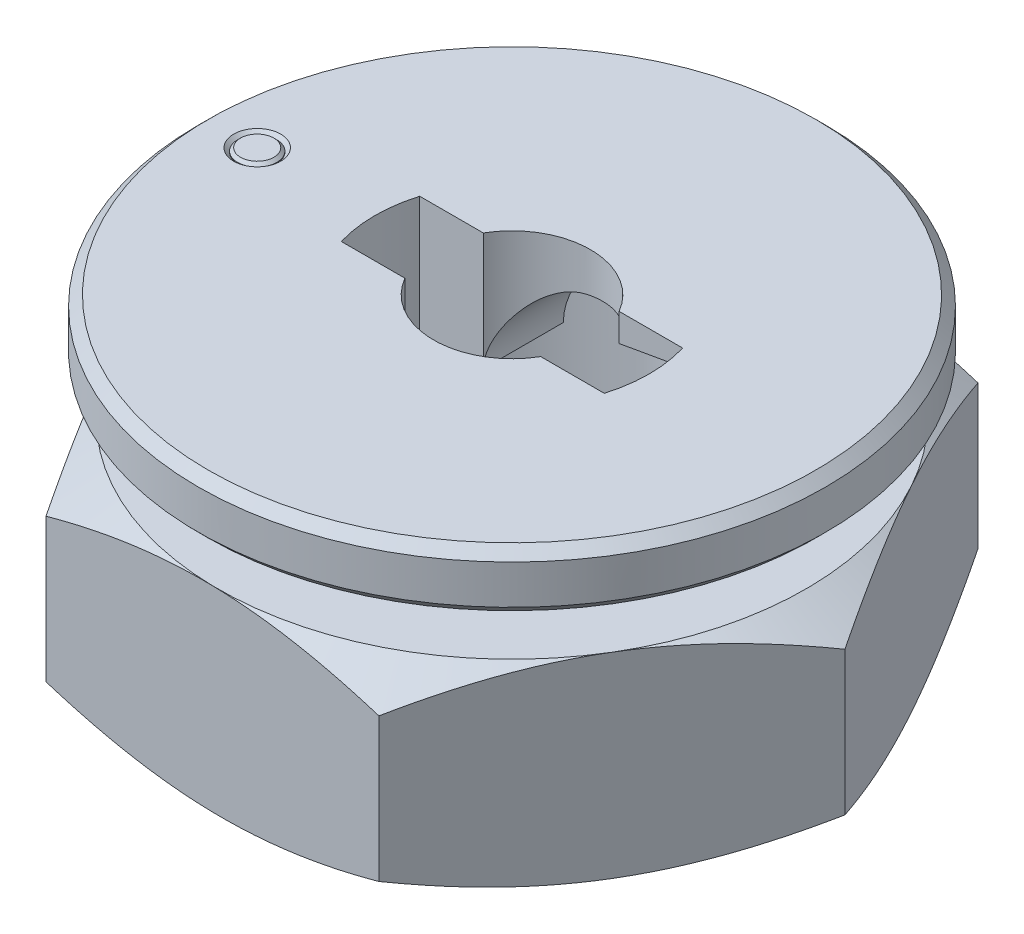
ISO-10303-21;
HEADER;
FILE_DESCRIPTION(('STEP AP214'),'2;1');
FILE_NAME('part.step','',(''),(''),'','','');
FILE_SCHEMA(('AUTOMOTIVE_DESIGN { 1 0 10303 214 1 1 1 1 }'));
ENDSEC;
DATA;
#1=APPLICATION_CONTEXT('core data for automotive mechanical design processes');
#2=APPLICATION_PROTOCOL_DEFINITION('international standard','automotive_design',2000,#1);
#3=PRODUCT_CONTEXT('',#1,'mechanical');
#4=PRODUCT('Part','Part','',(#3));
#5=PRODUCT_RELATED_PRODUCT_CATEGORY('part','',(#4));
#6=PRODUCT_DEFINITION_FORMATION('','',#4);
#7=PRODUCT_DEFINITION_CONTEXT('part definition',#1,'design');
#8=PRODUCT_DEFINITION('design','',#6,#7);
#9=PRODUCT_DEFINITION_SHAPE('','',#8);
#10=(LENGTH_UNIT() NAMED_UNIT(*) SI_UNIT(.MILLI.,.METRE.));
#11=(NAMED_UNIT(*) PLANE_ANGLE_UNIT() SI_UNIT($,.RADIAN.));
#12=(NAMED_UNIT(*) SI_UNIT($,.STERADIAN.) SOLID_ANGLE_UNIT());
#13=UNCERTAINTY_MEASURE_WITH_UNIT(LENGTH_MEASURE(1.E-05),#10,'distance_accuracy_value','');
#14=(GEOMETRIC_REPRESENTATION_CONTEXT(3) GLOBAL_UNCERTAINTY_ASSIGNED_CONTEXT((#13)) GLOBAL_UNIT_ASSIGNED_CONTEXT((#10,
#11,#12)) REPRESENTATION_CONTEXT('',''));
#15=CARTESIAN_POINT('',(0.,0.,0.));
#16=DIRECTION('',(0.,0.,1.));
#17=DIRECTION('',(1.,0.,0.));
#18=AXIS2_PLACEMENT_3D('',#15,#16,#17);
#19=CARTESIAN_POINT('',(-8.94513077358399,12.5,14.8318790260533));
#20=DIRECTION('',(0.0190970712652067,0.,-0.999817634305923));
#21=DIRECTION('',(-0.999817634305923,0.,-0.0190970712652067));
#22=AXIS2_PLACEMENT_3D('',#19,#20,#21);
#23=PLANE('',#22);
#24=DIRECTION('',(0.,-1.,0.));
#25=VECTOR('',#24,1.);
#26=CARTESIAN_POINT('',(-8.94513077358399,12.5,14.8318790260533));
#27=LINE('',#26,#25);
#28=CARTESIAN_POINT('',(-8.94513077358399,11.1602540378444,14.8318790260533));
#29=VERTEX_POINT('',#28);
#30=CARTESIAN_POINT('',(-8.94513077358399,3.83974596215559,14.8318790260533));
#31=VERTEX_POINT('',#30);
#32=EDGE_CURVE('P0_E251',#29,#31,#27,.T.);
#33=ORIENTED_EDGE('',*,*,#32,.T.);
#34=CARTESIAN_POINT('',(-23.6215090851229,9.85768755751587,14.5515520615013));
#35=CARTESIAN_POINT('',(-23.2936897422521,9.69844275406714,14.5578135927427));
#36=CARTESIAN_POINT('',(-22.9654877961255,9.53998623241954,14.5640824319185));
#37=CARTESIAN_POINT('',(-22.3082388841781,9.22482812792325,14.5766362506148));
#38=CARTESIAN_POINT('',(-21.9791919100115,9.06812656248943,14.5829212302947));
#39=CARTESIAN_POINT('',(-20.9905771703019,8.600881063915,14.6018043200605));
#40=CARTESIAN_POINT('',(-20.3296313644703,8.29324298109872,14.6144287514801));
#41=CARTESIAN_POINT('',(-18.9997821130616,7.68592144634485,14.6398296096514));
#42=CARTESIAN_POINT('',(-18.3308549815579,7.38628975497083,14.6526064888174));
#43=CARTESIAN_POINT('',(-16.9877080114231,6.79918073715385,14.6782613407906));
#44=CARTESIAN_POINT('',(-16.3134884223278,6.51170284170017,14.6911393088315));
#45=CARTESIAN_POINT('',(-14.9365957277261,5.94299154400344,14.7174387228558));
#46=CARTESIAN_POINT('',(-14.2337114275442,5.66226700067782,14.7308642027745));
#47=CARTESIAN_POINT('',(-12.8197429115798,5.12187771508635,14.7578717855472));
#48=CARTESIAN_POINT('',(-12.1086577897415,4.86221532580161,14.7714539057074));
#49=CARTESIAN_POINT('',(-10.6784858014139,4.37071493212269,14.7987709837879));
#50=CARTESIAN_POINT('',(-9.95941821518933,4.13882125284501,14.8125055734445));
#51=CARTESIAN_POINT('',(-8.51090031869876,3.71023534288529,14.8401730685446));
#52=CARTESIAN_POINT('',(-7.781453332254,3.51353210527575,14.8541059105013));
#53=CARTESIAN_POINT('',(-6.6813944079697,3.25249093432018,14.875117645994));
#54=CARTESIAN_POINT('',(-6.31475067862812,3.17132445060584,14.8821207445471));
#55=CARTESIAN_POINT('',(-5.57894372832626,3.02128775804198,14.8961750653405));
#56=CARTESIAN_POINT('',(-5.20978055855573,2.95241730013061,14.9032262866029));
#57=CARTESIAN_POINT('',(-4.46918269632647,2.82818341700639,14.9173721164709));
#58=CARTESIAN_POINT('',(-4.0977480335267,2.77281981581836,14.9244667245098));
#59=CARTESIAN_POINT('',(-3.35299706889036,2.67670160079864,14.9386918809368));
#60=CARTESIAN_POINT('',(-2.97968084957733,2.63594635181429,14.9458224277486));
#61=CARTESIAN_POINT('',(-2.23659334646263,2.57036932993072,14.9600158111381));
#62=CARTESIAN_POINT('',(-1.86684004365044,2.5453449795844,14.9670783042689));
#63=CARTESIAN_POINT('',(-1.12660718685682,2.51096222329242,14.9812171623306));
#64=CARTESIAN_POINT('',(-0.756127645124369,2.50160355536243,14.9882935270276));
#65=CARTESIAN_POINT('',(-0.0151042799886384,2.49877503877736,15.002447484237));
#66=CARTESIAN_POINT('',(0.35543954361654,2.50530524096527,15.0095250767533));
#67=CARTESIAN_POINT('',(1.09592002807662,2.53409423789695,15.0236686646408));
#68=CARTESIAN_POINT('',(1.46585666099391,2.55635373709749,15.0307346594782));
#69=CARTESIAN_POINT('',(2.35262152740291,2.62808972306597,15.0476723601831));
#70=CARTESIAN_POINT('',(2.86886722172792,2.68490086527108,15.0575329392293));
#71=CARTESIAN_POINT('',(3.89758067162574,2.82607872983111,15.0771819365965));
#72=CARTESIAN_POINT('',(4.41004791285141,2.91044913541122,15.0869703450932));
#73=CARTESIAN_POINT('',(5.43069804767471,3.10374429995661,15.106465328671));
#74=CARTESIAN_POINT('',(5.93887732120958,3.21268799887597,15.1161718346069));
#75=CARTESIAN_POINT('',(6.95016430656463,3.45180076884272,15.1354879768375));
#76=CARTESIAN_POINT('',(7.4532720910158,3.58196953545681,15.1450976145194));
#77=CARTESIAN_POINT('',(8.46550760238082,3.86344447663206,15.1644318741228));
#78=CARTESIAN_POINT('',(8.97452226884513,4.01515457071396,15.1741543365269));
#79=CARTESIAN_POINT('',(9.98753837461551,4.33439933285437,15.1935035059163));
#80=CARTESIAN_POINT('',(10.4915397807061,4.50193410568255,15.2031302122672));
#81=CARTESIAN_POINT('',(11.49477563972,4.85015508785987,15.2222925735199));
#82=CARTESIAN_POINT('',(11.9940115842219,5.03083701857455,15.2318282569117));
#83=CARTESIAN_POINT('',(12.9883369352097,5.40321201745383,15.2508204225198));
#84=CARTESIAN_POINT('',(13.4834263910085,5.59490495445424,15.260276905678));
#85=CARTESIAN_POINT('',(14.6543213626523,6.06085771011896,15.2826416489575));
#86=CARTESIAN_POINT('',(15.328501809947,6.33919657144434,15.2955188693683));
#87=CARTESIAN_POINT('',(16.6710878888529,6.90951480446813,15.321163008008));
#88=CARTESIAN_POINT('',(17.3394931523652,7.2014950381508,15.3339299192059));
#89=CARTESIAN_POINT('',(18.6716078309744,7.79635641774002,15.359374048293));
#90=CARTESIAN_POINT('',(19.3353161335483,8.09924004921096,15.3720512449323));
#91=CARTESIAN_POINT('',(20.6586696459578,8.71370114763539,15.3973280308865));
#92=CARTESIAN_POINT('',(21.3183149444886,9.02527842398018,15.4099276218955));
#93=CARTESIAN_POINT('',(22.6349522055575,9.65584759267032,15.4350761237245));
#94=CARTESIAN_POINT('',(23.2919403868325,9.97484736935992,15.4476249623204));
#95=CARTESIAN_POINT('',(24.6030656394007,10.6186543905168,15.4726681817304));
#96=CARTESIAN_POINT('',(25.2572026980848,10.9434616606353,15.4851625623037));
#97=CARTESIAN_POINT('',(26.5629786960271,11.5978418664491,15.5101036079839));
#98=CARTESIAN_POINT('',(27.2146179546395,11.92741416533,15.5225502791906));
#99=CARTESIAN_POINT('',(28.5158465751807,12.590584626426,15.5474044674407));
#100=CARTESIAN_POINT('',(29.1654359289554,12.9241828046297,15.5598119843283));
#101=CARTESIAN_POINT('',(31.0020400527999,13.8734296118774,15.5948921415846));
#102=CARTESIAN_POINT('',(32.1870001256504,14.4930550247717,15.6175255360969));
#103=CARTESIAN_POINT('',(34.5525010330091,15.740770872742,15.6627079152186));
#104=CARTESIAN_POINT('',(35.7330417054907,16.3688616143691,15.6852568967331));
#105=CARTESIAN_POINT('',(38.0876657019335,17.6299198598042,15.7302315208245));
#106=CARTESIAN_POINT('',(39.2617578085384,18.2628709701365,15.7526573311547));
#107=CARTESIAN_POINT('',(41.0208126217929,19.2160609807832,15.7862562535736));
#108=CARTESIAN_POINT('',(41.6068008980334,19.5344093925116,15.7974489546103));
#109=CARTESIAN_POINT('',(42.778161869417,20.1722350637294,15.8198225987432));
#110=CARTESIAN_POINT('',(43.3635345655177,20.4917123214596,15.8310035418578));
#111=CARTESIAN_POINT('',(43.9486344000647,20.8116888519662,15.8421792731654));
#112=B_SPLINE_CURVE_WITH_KNOTS('',3,(#34,#35,#36,#37,#38,#39,#40,#41,#42,#43,#44,#45,#46,#47,
#48,#49,#50,#51,#52,#53,#54,#55,#56,#57,#58,#59,#60,#61,#62,#63,#64,#65,#66,#67,#68,#69,#70,#71,
#72,#73,#74,#75,#76,#77,#78,#79,#80,#81,#82,#83,#84,#85,#86,#87,#88,#89,#90,#91,#92,#93,#94,#95,
#96,#97,#98,#99,#100,#101,#102,#103,#104,#105,#106,#107,#108,#109,#110,#111),.UNSPECIFIED.,.F.,
.F.,(4,2,2,2,2,2,2,2,2,2,2,2,2,2,2,2,2,2,2,2,2,2,2,2,2,2,2,2,2,2,2,2,2,2,2,2,2,2,4),(0.,
1.09351197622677,2.18703479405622,4.37440006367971,6.57354505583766,8.77258697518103,
11.0432972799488,13.3142609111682,15.5805923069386,17.8462135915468,18.9727980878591,
20.0993597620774,21.2259067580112,22.3524047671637,23.4640817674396,24.5757401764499,
25.6874021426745,26.7991138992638,28.3566212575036,29.9143368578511,31.4732572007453,
33.0321551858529,34.6255411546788,36.2189376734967,37.8118179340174,39.4046792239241,
41.5929490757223,43.7813573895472,45.970267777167,48.1591302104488,50.3504346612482,
52.5417487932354,54.7327727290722,56.9238053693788,60.9358857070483,64.9481117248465,
68.9501694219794,70.9510881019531,72.9520036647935),.UNSPECIFIED.);
#113=CARTESIAN_POINT('',(-0.286456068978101,2.5,14.9972645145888));
#114=VERTEX_POINT('',#113);
#115=EDGE_CURVE('P0_E34',#31,#114,#112,.T.);
#116=ORIENTED_EDGE('',*,*,#115,.T.);
#117=CARTESIAN_POINT('',(8.37221863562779,3.83974596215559,15.1626500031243));
#118=VERTEX_POINT('',#117);
#119=EDGE_CURVE('P0_E322',#114,#118,#112,.T.);
#120=ORIENTED_EDGE('',*,*,#119,.T.);
#121=DIRECTION('',(0.,-1.,0.));
#122=VECTOR('',#121,1.);
#123=CARTESIAN_POINT('',(8.37221863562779,12.5,15.1626500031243));
#124=LINE('',#123,#122);
#125=CARTESIAN_POINT('',(8.37221863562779,11.1602540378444,15.1626500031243));
#126=VERTEX_POINT('',#125);
#127=EDGE_CURVE('P0_E230',#126,#118,#124,.T.);
#128=ORIENTED_EDGE('',*,*,#127,.F.);
#129=CARTESIAN_POINT('',(-23.6215090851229,5.14231244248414,14.5515520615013));
#130=CARTESIAN_POINT('',(-23.2936897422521,5.30155724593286,14.5578135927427));
#131=CARTESIAN_POINT('',(-22.9654877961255,5.46001376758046,14.5640824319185));
#132=CARTESIAN_POINT('',(-22.3082388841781,5.77517187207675,14.5766362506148));
#133=CARTESIAN_POINT('',(-21.9791919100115,5.93187343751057,14.5829212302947));
#134=CARTESIAN_POINT('',(-20.9905771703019,6.399118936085,14.6018043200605));
#135=CARTESIAN_POINT('',(-20.3296313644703,6.70675701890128,14.6144287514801));
#136=CARTESIAN_POINT('',(-18.9997821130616,7.31407855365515,14.6398296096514));
#137=CARTESIAN_POINT('',(-18.3308549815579,7.61371024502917,14.6526064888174));
#138=CARTESIAN_POINT('',(-16.9877080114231,8.20081926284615,14.6782613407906));
#139=CARTESIAN_POINT('',(-16.3134884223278,8.48829715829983,14.6911393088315));
#140=CARTESIAN_POINT('',(-14.9365957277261,9.05700845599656,14.7174387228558));
#141=CARTESIAN_POINT('',(-14.2337114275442,9.33773299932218,14.7308642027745));
#142=CARTESIAN_POINT('',(-12.8197429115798,9.87812228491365,14.7578717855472));
#143=CARTESIAN_POINT('',(-12.1086577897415,10.1377846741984,14.7714539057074));
#144=CARTESIAN_POINT('',(-10.6784858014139,10.6292850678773,14.7987709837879));
#145=CARTESIAN_POINT('',(-9.95941821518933,10.861178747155,14.8125055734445));
#146=CARTESIAN_POINT('',(-8.51090031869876,11.2897646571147,14.8401730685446));
#147=CARTESIAN_POINT('',(-7.781453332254,11.4864678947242,14.8541059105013));
#148=CARTESIAN_POINT('',(-6.6813944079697,11.7475090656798,14.875117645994));
#149=CARTESIAN_POINT('',(-6.31475067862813,11.8286755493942,14.8821207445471));
#150=CARTESIAN_POINT('',(-5.57894372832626,11.978712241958,14.8961750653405));
#151=CARTESIAN_POINT('',(-5.20978055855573,12.0475826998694,14.9032262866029));
#152=CARTESIAN_POINT('',(-4.46918269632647,12.1718165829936,14.9173721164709));
#153=CARTESIAN_POINT('',(-4.0977480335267,12.2271801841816,14.9244667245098));
#154=CARTESIAN_POINT('',(-3.35299706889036,12.3232983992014,14.9386918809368));
#155=CARTESIAN_POINT('',(-2.97968084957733,12.3640536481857,14.9458224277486));
#156=CARTESIAN_POINT('',(-2.23659334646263,12.4296306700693,14.9600158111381));
#157=CARTESIAN_POINT('',(-1.86684004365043,12.4546550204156,14.9670783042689));
#158=CARTESIAN_POINT('',(-1.12660718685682,12.4890377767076,14.9812171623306));
#159=CARTESIAN_POINT('',(-0.756127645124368,12.4983964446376,14.9882935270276));
#160=CARTESIAN_POINT('',(-0.0151042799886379,12.5012249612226,15.002447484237));
#161=CARTESIAN_POINT('',(0.35543954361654,12.4946947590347,15.0095250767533));
#162=CARTESIAN_POINT('',(1.09592002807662,12.4659057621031,15.0236686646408));
#163=CARTESIAN_POINT('',(1.46585666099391,12.4436462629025,15.0307346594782));
#164=CARTESIAN_POINT('',(2.35262152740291,12.371910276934,15.0476723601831));
#165=CARTESIAN_POINT('',(2.86886722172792,12.3150991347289,15.0575329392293));
#166=CARTESIAN_POINT('',(3.89758067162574,12.1739212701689,15.0771819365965));
#167=CARTESIAN_POINT('',(4.41004791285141,12.0895508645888,15.0869703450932));
#168=CARTESIAN_POINT('',(5.43069804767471,11.8962557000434,15.106465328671));
#169=CARTESIAN_POINT('',(5.93887732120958,11.787312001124,15.1161718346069));
#170=CARTESIAN_POINT('',(6.95016430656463,11.5481992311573,15.1354879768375));
#171=CARTESIAN_POINT('',(7.4532720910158,11.4180304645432,15.1450976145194));
#172=CARTESIAN_POINT('',(8.46550760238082,11.1365555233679,15.1644318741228));
#173=CARTESIAN_POINT('',(8.97452226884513,10.984845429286,15.1741543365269));
#174=CARTESIAN_POINT('',(9.98753837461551,10.6656006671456,15.1935035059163));
#175=CARTESIAN_POINT('',(10.4915397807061,10.4980658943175,15.2031302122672));
#176=CARTESIAN_POINT('',(11.49477563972,10.1498449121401,15.2222925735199));
#177=CARTESIAN_POINT('',(11.9940115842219,9.96916298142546,15.2318282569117));
#178=CARTESIAN_POINT('',(12.9883369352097,9.59678798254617,15.2508204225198));
#179=CARTESIAN_POINT('',(13.4834263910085,9.40509504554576,15.260276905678));
#180=CARTESIAN_POINT('',(14.6543213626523,8.93914228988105,15.2826416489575));
#181=CARTESIAN_POINT('',(15.328501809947,8.66080342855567,15.2955188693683));
#182=CARTESIAN_POINT('',(16.6710878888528,8.09048519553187,15.321163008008));
#183=CARTESIAN_POINT('',(17.3394931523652,7.79850496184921,15.3339299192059));
#184=CARTESIAN_POINT('',(18.6716078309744,7.20364358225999,15.359374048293));
#185=CARTESIAN_POINT('',(19.3353161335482,6.90075995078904,15.3720512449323));
#186=CARTESIAN_POINT('',(20.6586696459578,6.28629885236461,15.3973280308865));
#187=CARTESIAN_POINT('',(21.3183149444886,5.97472157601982,15.4099276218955));
#188=CARTESIAN_POINT('',(22.6349522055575,5.34415240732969,15.4350761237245));
#189=CARTESIAN_POINT('',(23.2919403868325,5.02515263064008,15.4476249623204));
#190=CARTESIAN_POINT('',(24.6030656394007,4.38134560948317,15.4726681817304));
#191=CARTESIAN_POINT('',(25.2572026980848,4.05653833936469,15.4851625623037));
#192=CARTESIAN_POINT('',(26.5629786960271,3.4021581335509,15.5101036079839));
#193=CARTESIAN_POINT('',(27.2146179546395,3.07258583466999,15.5225502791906));
#194=CARTESIAN_POINT('',(28.5158465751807,2.40941537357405,15.5474044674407));
#195=CARTESIAN_POINT('',(29.1654359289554,2.07581719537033,15.5598119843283));
#196=CARTESIAN_POINT('',(31.0020400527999,1.12657038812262,15.5948921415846));
#197=CARTESIAN_POINT('',(32.1870001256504,0.506944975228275,15.6175255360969));
#198=CARTESIAN_POINT('',(34.5525010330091,-0.740770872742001,15.6627079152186));
#199=CARTESIAN_POINT('',(35.7330417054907,-1.3688616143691,15.6852568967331));
#200=CARTESIAN_POINT('',(38.0876657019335,-2.62991985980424,15.7302315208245));
#201=CARTESIAN_POINT('',(39.2617578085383,-3.2628709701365,15.7526573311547));
#202=CARTESIAN_POINT('',(41.0208126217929,-4.21606098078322,15.7862562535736));
#203=CARTESIAN_POINT('',(41.6068008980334,-4.53440939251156,15.7974489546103));
#204=CARTESIAN_POINT('',(42.778161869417,-5.1722350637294,15.8198225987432));
#205=CARTESIAN_POINT('',(43.3635345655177,-5.49171232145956,15.8310035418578));
#206=CARTESIAN_POINT('',(43.9486344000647,-5.81168885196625,15.8421792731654));
#207=B_SPLINE_CURVE_WITH_KNOTS('',3,(#129,#130,#131,#132,#133,#134,#135,#136,#137,#138,#139,
#140,#141,#142,#143,#144,#145,#146,#147,#148,#149,#150,#151,#152,#153,#154,#155,#156,#157,#158,
#159,#160,#161,#162,#163,#164,#165,#166,#167,#168,#169,#170,#171,#172,#173,#174,#175,#176,#177,
#178,#179,#180,#181,#182,#183,#184,#185,#186,#187,#188,#189,#190,#191,#192,#193,#194,#195,#196,
#197,#198,#199,#200,#201,#202,#203,#204,#205,#206),.UNSPECIFIED.,.F.,.F.,(4,2,2,2,2,2,2,2,2,2,2,
2,2,2,2,2,2,2,2,2,2,2,2,2,2,2,2,2,2,2,2,2,2,2,2,2,2,2,4),(0.,1.09351197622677,2.18703479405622,
4.37440006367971,6.57354505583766,8.77258697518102,11.0432972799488,13.3142609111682,
15.5805923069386,17.8462135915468,18.9727980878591,20.0993597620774,21.2259067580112,
22.3524047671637,23.4640817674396,24.5757401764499,25.6874021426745,26.7991138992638,
28.3566212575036,29.9143368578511,31.4732572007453,33.0321551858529,34.6255411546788,
36.2189376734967,37.8118179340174,39.4046792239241,41.5929490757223,43.7813573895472,
45.970267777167,48.1591302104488,50.3504346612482,52.5417487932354,54.7327727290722,
56.9238053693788,60.9358857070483,64.9481117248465,68.9501694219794,70.9510881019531,
72.9520036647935),.UNSPECIFIED.);
#208=CARTESIAN_POINT('',(-0.286456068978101,12.5,14.9972645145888));
#209=VERTEX_POINT('',#208);
#210=EDGE_CURVE('P0_E221',#126,#209,#207,.F.);
#211=ORIENTED_EDGE('',*,*,#210,.T.);
#212=EDGE_CURVE('P0_E181',#209,#29,#207,.F.);
#213=ORIENTED_EDGE('',*,*,#212,.T.);
#214=EDGE_LOOP('',(#33,#116,#120,#128,#211,#213));
#215=FACE_BOUND('',#214,.T.);
#216=ADVANCED_FACE('P0_F16',(#215),#23,.F.);
#217=CARTESIAN_POINT('',(8.37221863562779,12.5,15.1626500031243));
#218=DIRECTION('',(-0.856318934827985,0.,-0.516447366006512));
#219=DIRECTION('',(-0.516447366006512,0.,0.856318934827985));
#220=AXIS2_PLACEMENT_3D('',#217,#218,#219);
#221=PLANE('',#220);
#222=ORIENTED_EDGE('',*,*,#127,.T.);
#223=CARTESIAN_POINT('',(8.37209936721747,3.83981262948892,15.1628477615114));
#224=CARTESIAN_POINT('',(8.56870982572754,3.72992178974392,14.8368488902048));
#225=CARTESIAN_POINT('',(8.76608717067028,3.6250175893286,14.5095784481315));
#226=CARTESIAN_POINT('',(9.16242459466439,3.42656858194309,13.8524132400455));
#227=CARTESIAN_POINT('',(9.36138517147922,3.33302751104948,13.5225176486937));
#228=CARTESIAN_POINT('',(9.76127357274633,3.15856214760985,12.8594645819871));
#229=CARTESIAN_POINT('',(9.96220489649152,3.07766770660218,12.5263013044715));
#230=CARTESIAN_POINT('',(10.3654637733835,2.93023264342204,11.8576596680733));
#231=CARTESIAN_POINT('',(10.5677912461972,2.86369120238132,11.522181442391));
#232=CARTESIAN_POINT('',(10.9686580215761,2.74779237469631,10.8575061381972));
#233=CARTESIAN_POINT('',(11.1671675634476,2.69805138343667,10.5283584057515));
#234=CARTESIAN_POINT('',(11.5650962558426,2.61464674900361,9.86855472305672));
#235=CARTESIAN_POINT('',(11.7645154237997,2.58098341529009,9.53789874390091));
#236=CARTESIAN_POINT('',(12.1636887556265,2.53058407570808,8.87603133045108));
#237=CARTESIAN_POINT('',(12.3634422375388,2.51382795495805,8.54482102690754));
#238=CARTESIAN_POINT('',(12.7631335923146,2.49760339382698,7.88209468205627));
#239=CARTESIAN_POINT('',(12.9630714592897,2.49813441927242,7.55057865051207));
#240=CARTESIAN_POINT('',(13.336853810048,2.51527661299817,6.93081190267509));
#241=CARTESIAN_POINT('',(13.5107249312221,2.52979684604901,6.64251701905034));
#242=CARTESIAN_POINT('',(13.8580672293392,2.57163714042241,6.06659039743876));
#243=CARTESIAN_POINT('',(14.0315383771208,2.59895810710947,5.77895870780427));
#244=CARTESIAN_POINT('',(14.3779865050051,2.6659235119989,5.20451470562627));
#245=CARTESIAN_POINT('',(14.5509629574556,2.70557812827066,4.91770326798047));
#246=CARTESIAN_POINT('',(14.8961049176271,2.7965151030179,4.34542501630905));
#247=CARTESIAN_POINT('',(15.068270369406,2.84779825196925,4.05995829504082));
#248=CARTESIAN_POINT('',(15.5908881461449,3.0203868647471,3.19340823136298));
#249=CARTESIAN_POINT('',(15.9398270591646,3.15890117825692,2.61483427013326));
#250=CARTESIAN_POINT('',(16.6325017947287,3.4732719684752,1.4663135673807));
#251=CARTESIAN_POINT('',(16.9762464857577,3.64905461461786,0.896352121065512));
#252=CARTESIAN_POINT('',(17.3174686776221,3.83981262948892,0.330573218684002));
#253=B_SPLINE_CURVE_WITH_KNOTS('',3,(#223,#224,#225,#226,#227,#228,#229,#230,#231,#232,#233,
#234,#235,#236,#237,#238,#239,#240,#241,#242,#243,#244,#245,#246,#247,#248,#249,#250,#251,#252),
.UNSPECIFIED.,.F.,.F.,(4,2,2,2,2,2,2,2,2,2,2,2,2,2,4),(0.,1.18875411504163,2.37789802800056,
3.56980778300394,4.76164951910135,5.92407379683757,7.0865204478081,8.24758247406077,
9.40860862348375,10.4193068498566,11.4300765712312,12.4416826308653,13.4533574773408,
15.5211962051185,17.5849760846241),.UNSPECIFIED.);
#254=CARTESIAN_POINT('',(12.8447840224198,2.5,7.74671049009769));
#255=VERTEX_POINT('',#254);
#256=EDGE_CURVE('P0_E321',#118,#255,#253,.T.);
#257=ORIENTED_EDGE('',*,*,#256,.T.);
#258=CARTESIAN_POINT('',(17.3173494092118,3.83974596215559,0.330770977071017));
#259=VERTEX_POINT('',#258);
#260=EDGE_CURVE('P0_E315',#255,#259,#253,.T.);
#261=ORIENTED_EDGE('',*,*,#260,.T.);
#262=DIRECTION('',(0.,-1.,0.));
#263=VECTOR('',#262,1.);
#264=CARTESIAN_POINT('',(17.3173494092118,12.5,0.330770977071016));
#265=LINE('',#264,#263);
#266=CARTESIAN_POINT('',(17.3173494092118,11.1602540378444,0.330770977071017));
#267=VERTEX_POINT('',#266);
#268=EDGE_CURVE('P0_E263',#267,#259,#265,.T.);
#269=ORIENTED_EDGE('',*,*,#268,.F.);
#270=CARTESIAN_POINT('',(17.3174686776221,11.1601873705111,0.330573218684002));
#271=CARTESIAN_POINT('',(17.120858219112,11.2700782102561,0.656572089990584));
#272=CARTESIAN_POINT('',(16.9234808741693,11.3749824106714,0.983842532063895));
#273=CARTESIAN_POINT('',(16.5271434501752,11.5734314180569,1.64100774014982));
#274=CARTESIAN_POINT('',(16.3281828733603,11.6669724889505,1.9709033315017));
#275=CARTESIAN_POINT('',(15.9282944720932,11.8414378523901,2.63395639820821));
#276=CARTESIAN_POINT('',(15.727363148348,11.9223322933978,2.96711967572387));
#277=CARTESIAN_POINT('',(15.324104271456,12.069767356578,3.63576131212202));
#278=CARTESIAN_POINT('',(15.1217767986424,12.1363087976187,3.97123953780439));
#279=CARTESIAN_POINT('',(14.7209100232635,12.2522076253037,4.63591484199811));
#280=CARTESIAN_POINT('',(14.5224004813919,12.3019486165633,4.96506257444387));
#281=CARTESIAN_POINT('',(14.124471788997,12.3853532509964,5.62486625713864));
#282=CARTESIAN_POINT('',(13.9250526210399,12.4190165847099,5.95552223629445));
#283=CARTESIAN_POINT('',(13.525879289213,12.4694159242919,6.61738964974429));
#284=CARTESIAN_POINT('',(13.3261258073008,12.486172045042,6.94859995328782));
#285=CARTESIAN_POINT('',(12.926434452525,12.502396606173,7.6113262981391));
#286=CARTESIAN_POINT('',(12.7264965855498,12.5018655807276,7.94284232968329));
#287=CARTESIAN_POINT('',(12.3527142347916,12.4847233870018,8.56260907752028));
#288=CARTESIAN_POINT('',(12.1788431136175,12.470203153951,8.85090396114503));
#289=CARTESIAN_POINT('',(11.8315008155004,12.4283628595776,9.42683058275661));
#290=CARTESIAN_POINT('',(11.6580296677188,12.4010418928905,9.71446227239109));
#291=CARTESIAN_POINT('',(11.3115815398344,12.3340764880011,10.2889062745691));
#292=CARTESIAN_POINT('',(11.1386050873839,12.2944218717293,10.5757177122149));
#293=CARTESIAN_POINT('',(10.7934631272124,12.2034848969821,11.1479959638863));
#294=CARTESIAN_POINT('',(10.6212976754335,12.1522017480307,11.4334626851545));
#295=CARTESIAN_POINT('',(10.0986798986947,11.9796131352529,12.3000127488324));
#296=CARTESIAN_POINT('',(9.74974098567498,11.8410988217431,12.8785867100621));
#297=CARTESIAN_POINT('',(9.05706625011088,11.5267280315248,14.0271074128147));
#298=CARTESIAN_POINT('',(8.71332155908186,11.3509453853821,14.5970688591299));
#299=CARTESIAN_POINT('',(8.37209936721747,11.1601873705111,15.1628477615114));
#300=B_SPLINE_CURVE_WITH_KNOTS('',3,(#270,#271,#272,#273,#274,#275,#276,#277,#278,#279,#280,
#281,#282,#283,#284,#285,#286,#287,#288,#289,#290,#291,#292,#293,#294,#295,#296,#297,#298,#299),
.UNSPECIFIED.,.F.,.F.,(4,2,2,2,2,2,2,2,2,2,2,2,2,2,4),(0.,1.18875411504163,2.37789802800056,
3.56980778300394,4.76164951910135,5.92407379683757,7.0865204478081,8.24758247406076,
9.40860862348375,10.4193068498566,11.4300765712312,12.4416826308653,13.4533574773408,
15.5211962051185,17.5849760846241),.UNSPECIFIED.);
#301=CARTESIAN_POINT('',(12.8447840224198,12.5,7.74671049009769));
#302=VERTEX_POINT('',#301);
#303=EDGE_CURVE('P0_E244',#267,#302,#300,.T.);
#304=ORIENTED_EDGE('',*,*,#303,.T.);
#305=EDGE_CURVE('P0_E178',#302,#126,#300,.T.);
#306=ORIENTED_EDGE('',*,*,#305,.T.);
#307=EDGE_LOOP('',(#222,#257,#261,#269,#304,#306));
#308=FACE_BOUND('',#307,.T.);
#309=ADVANCED_FACE('P0_F241',(#308),#221,.F.);
#310=CARTESIAN_POINT('',(17.3173494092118,12.5,0.330770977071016));
#311=DIRECTION('',(-0.875416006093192,0.,0.483370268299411));
#312=DIRECTION('',(0.483370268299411,0.,0.875416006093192));
#313=AXIS2_PLACEMENT_3D('',#310,#311,#312);
#314=PLANE('',#313);
#315=ORIENTED_EDGE('',*,*,#268,.T.);
#316=CARTESIAN_POINT('',(17.3174610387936,3.83981262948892,0.330973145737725));
#317=CARTESIAN_POINT('',(17.1334429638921,3.72992178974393,-0.00229594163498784));
#318=CARTESIAN_POINT('',(16.9487071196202,3.6250175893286,-0.336864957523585));
#319=CARTESIAN_POINT('',(16.5777540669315,3.42656858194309,-1.00868583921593));
#320=CARTESIAN_POINT('',(16.3915363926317,3.33302751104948,-1.34593854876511));
#321=CARTESIAN_POINT('',(16.0172597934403,3.15856214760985,-2.02377859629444));
#322=CARTESIAN_POINT('',(15.8291975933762,3.07766770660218,-2.36437186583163));
#323=CARTESIAN_POINT('',(15.4517663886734,2.93023264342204,-3.04792511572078));
#324=CARTESIAN_POINT('',(15.2623974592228,2.86369120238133,-3.39088495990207));
#325=CARTESIAN_POINT('',(14.8872051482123,2.74779237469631,-4.07038342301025));
#326=CARTESIAN_POINT('',(14.701409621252,2.69805138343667,-4.40687159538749));
#327=CARTESIAN_POINT('',(14.3289672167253,2.61464674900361,-5.0813897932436));
#328=CARTESIAN_POINT('',(14.1423203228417,2.58098341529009,-5.41941984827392));
#329=CARTESIAN_POINT('',(13.7687129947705,2.53058407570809,-6.09604780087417));
#330=CARTESIAN_POINT('',(13.5817531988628,2.51382795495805,-6.43464454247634));
#331=CARTESIAN_POINT('',(13.2076610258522,2.49760339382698,-7.11215058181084));
#332=CARTESIAN_POINT('',(13.0205286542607,2.49813441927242,-7.45105986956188));
#333=CARTESIAN_POINT('',(12.6706860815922,2.51527661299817,-8.08464825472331));
#334=CARTESIAN_POINT('',(12.5079509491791,2.52979684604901,-8.37937250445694));
#335=CARTESIAN_POINT('',(12.1828550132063,2.57163714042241,-8.968143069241));
#336=CARTESIAN_POINT('',(12.0204942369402,2.59895810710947,-9.26218933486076));
#337=CARTESIAN_POINT('',(11.6962352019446,2.6659235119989,-9.84944421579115));
#338=CARTESIAN_POINT('',(11.5343374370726,2.70557812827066,-10.1426519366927));
#339=CARTESIAN_POINT('',(11.2113009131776,2.7965151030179,-10.7276927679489));
#340=CARTESIAN_POINT('',(11.0501622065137,2.84779825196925,-11.0195257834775));
#341=CARTESIAN_POINT('',(10.5610167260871,3.0203868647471,-11.9054010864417));
#342=CARTESIAN_POINT('',(10.2344264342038,3.15890117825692,-12.4968780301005));
#343=CARTESIAN_POINT('',(9.58611569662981,3.4732719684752,-13.671012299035));
#344=CARTESIAN_POINT('',(9.26438695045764,3.64905461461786,-14.2536846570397));
#345=CARTESIAN_POINT('',(8.94501914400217,3.83981262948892,-14.83208119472));
#346=B_SPLINE_CURVE_WITH_KNOTS('',3,(#316,#317,#318,#319,#320,#321,#322,#323,#324,#325,#326,
#327,#328,#329,#330,#331,#332,#333,#334,#335,#336,#337,#338,#339,#340,#341,#342,#343,#344,#345),
.UNSPECIFIED.,.F.,.F.,(4,2,2,2,2,2,2,2,2,2,2,2,2,2,4),(0.,1.18875411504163,2.37789802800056,
3.56980778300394,4.76164951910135,5.92407379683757,7.0865204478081,8.24758247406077,
9.40860862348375,10.4193068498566,11.4300765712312,12.4416826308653,13.4533574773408,
15.5211962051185,17.5849760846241),.UNSPECIFIED.);
#347=CARTESIAN_POINT('',(13.1312400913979,2.5,-7.25055402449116));
#348=VERTEX_POINT('',#347);
#349=EDGE_CURVE('P0_E139',#259,#348,#346,.T.);
#350=ORIENTED_EDGE('',*,*,#349,.T.);
#351=CARTESIAN_POINT('',(8.94513077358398,3.83974596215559,-14.8318790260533));
#352=VERTEX_POINT('',#351);
#353=EDGE_CURVE('P0_E122',#348,#352,#346,.T.);
#354=ORIENTED_EDGE('',*,*,#353,.T.);
#355=DIRECTION('',(0.,-1.,0.));
#356=VECTOR('',#355,1.);
#357=CARTESIAN_POINT('',(8.94513077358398,12.5,-14.8318790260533));
#358=LINE('',#357,#356);
#359=CARTESIAN_POINT('',(8.94513077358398,11.1602540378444,-14.8318790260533));
#360=VERTEX_POINT('',#359);
#361=EDGE_CURVE('P0_E138',#360,#352,#358,.T.);
#362=ORIENTED_EDGE('',*,*,#361,.F.);
#363=CARTESIAN_POINT('',(8.94501914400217,11.1601873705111,-14.83208119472));
#364=CARTESIAN_POINT('',(9.1290372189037,11.2700782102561,-14.4988121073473));
#365=CARTESIAN_POINT('',(9.31377306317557,11.3749824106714,-14.1642430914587));
#366=CARTESIAN_POINT('',(9.68472611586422,11.5734314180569,-13.4924222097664));
#367=CARTESIAN_POINT('',(9.87094379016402,11.6669724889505,-13.1551695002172));
#368=CARTESIAN_POINT('',(10.2452203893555,11.8414378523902,-12.4773294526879));
#369=CARTESIAN_POINT('',(10.4332825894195,11.9223322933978,-12.1367361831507));
#370=CARTESIAN_POINT('',(10.8107137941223,12.069767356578,-11.4531829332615));
#371=CARTESIAN_POINT('',(11.000082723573,12.1363087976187,-11.1102230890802));
#372=CARTESIAN_POINT('',(11.3752750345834,12.2522076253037,-10.4307246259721));
#373=CARTESIAN_POINT('',(11.5610705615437,12.3019486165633,-10.0942364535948));
#374=CARTESIAN_POINT('',(11.9335129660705,12.3853532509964,-9.41971825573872));
#375=CARTESIAN_POINT('',(12.120159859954,12.4190165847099,-9.08168820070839));
#376=CARTESIAN_POINT('',(12.4937671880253,12.4694159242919,-8.40506024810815));
#377=CARTESIAN_POINT('',(12.680726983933,12.486172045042,-8.06646350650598));
#378=CARTESIAN_POINT('',(13.0548191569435,12.502396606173,-7.38895746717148));
#379=CARTESIAN_POINT('',(13.241951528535,12.5018655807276,-7.05004817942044));
#380=CARTESIAN_POINT('',(13.5917941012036,12.4847233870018,-6.41645979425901));
#381=CARTESIAN_POINT('',(13.7545292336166,12.470203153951,-6.12173554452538));
#382=CARTESIAN_POINT('',(14.0796251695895,12.4283628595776,-5.53296497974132));
#383=CARTESIAN_POINT('',(14.2419859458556,12.4010418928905,-5.23891871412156));
#384=CARTESIAN_POINT('',(14.5662449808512,12.3340764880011,-4.65166383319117));
#385=CARTESIAN_POINT('',(14.7281427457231,12.2944218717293,-4.35845611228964));
#386=CARTESIAN_POINT('',(15.0511792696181,12.2034848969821,-3.77341528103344));
#387=CARTESIAN_POINT('',(15.212317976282,12.1522017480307,-3.48158226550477));
#388=CARTESIAN_POINT('',(15.7014634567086,11.9796131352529,-2.59570696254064));
#389=CARTESIAN_POINT('',(16.0280537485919,11.8410988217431,-2.00423001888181));
#390=CARTESIAN_POINT('',(16.676364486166,11.5267280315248,-0.830095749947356));
#391=CARTESIAN_POINT('',(16.9980932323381,11.3509453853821,-0.247423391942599));
#392=CARTESIAN_POINT('',(17.3174610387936,11.1601873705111,0.330973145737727));
#393=B_SPLINE_CURVE_WITH_KNOTS('',3,(#363,#364,#365,#366,#367,#368,#369,#370,#371,#372,#373,
#374,#375,#376,#377,#378,#379,#380,#381,#382,#383,#384,#385,#386,#387,#388,#389,#390,#391,#392),
.UNSPECIFIED.,.F.,.F.,(4,2,2,2,2,2,2,2,2,2,2,2,2,2,4),(0.,1.18875411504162,2.37789802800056,
3.56980778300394,4.76164951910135,5.92407379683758,7.0865204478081,8.24758247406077,
9.40860862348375,10.4193068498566,11.4300765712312,12.4416826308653,13.4533574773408,
15.5211962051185,17.5849760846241),.UNSPECIFIED.);
#394=CARTESIAN_POINT('',(13.1312400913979,12.5,-7.25055402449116));
#395=VERTEX_POINT('',#394);
#396=EDGE_CURVE('P0_E247',#360,#395,#393,.T.);
#397=ORIENTED_EDGE('',*,*,#396,.T.);
#398=EDGE_CURVE('P0_E245',#395,#267,#393,.T.);
#399=ORIENTED_EDGE('',*,*,#398,.T.);
#400=EDGE_LOOP('',(#315,#350,#354,#362,#397,#399));
#401=FACE_BOUND('',#400,.T.);
#402=ADVANCED_FACE('P0_F165',(#401),#314,.F.);
#403=CARTESIAN_POINT('',(8.94513077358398,12.5,-14.8318790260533));
#404=DIRECTION('',(-0.0190970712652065,0.,0.999817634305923));
#405=DIRECTION('',(0.999817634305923,0.,0.0190970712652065));
#406=AXIS2_PLACEMENT_3D('',#403,#404,#405);
#407=PLANE('',#406);
#408=ORIENTED_EDGE('',*,*,#361,.T.);
#409=CARTESIAN_POINT('',(-23.0485969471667,9.85768755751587,-15.4429769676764));
#410=CARTESIAN_POINT('',(-22.7207776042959,9.69844275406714,-15.436715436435));
#411=CARTESIAN_POINT('',(-22.3925756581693,9.53998623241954,-15.4304465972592));
#412=CARTESIAN_POINT('',(-21.7353267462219,9.22482812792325,-15.4178927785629));
#413=CARTESIAN_POINT('',(-21.4062797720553,9.06812656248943,-15.411607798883));
#414=CARTESIAN_POINT('',(-20.4176650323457,8.60088106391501,-15.3927247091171));
#415=CARTESIAN_POINT('',(-19.7567192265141,8.29324298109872,-15.3801002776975));
#416=CARTESIAN_POINT('',(-18.4268699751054,7.68592144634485,-15.3546994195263));
#417=CARTESIAN_POINT('',(-17.7579428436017,7.38628975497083,-15.3419225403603));
#418=CARTESIAN_POINT('',(-16.4147958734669,6.79918073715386,-15.3162676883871));
#419=CARTESIAN_POINT('',(-15.7405762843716,6.51170284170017,-15.3033897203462));
#420=CARTESIAN_POINT('',(-14.3636835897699,5.94299154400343,-15.2770903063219));
#421=CARTESIAN_POINT('',(-13.660799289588,5.66226700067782,-15.2636648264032));
#422=CARTESIAN_POINT('',(-12.2468307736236,5.12187771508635,-15.2366572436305));
#423=CARTESIAN_POINT('',(-11.5357456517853,4.86221532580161,-15.2230751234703));
#424=CARTESIAN_POINT('',(-10.1055736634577,4.37071493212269,-15.1957580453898));
#425=CARTESIAN_POINT('',(-9.38650607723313,4.13882125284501,-15.1820234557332));
#426=CARTESIAN_POINT('',(-7.93798818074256,3.71023534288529,-15.1543559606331));
#427=CARTESIAN_POINT('',(-7.2085411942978,3.51353210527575,-15.1404231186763));
#428=CARTESIAN_POINT('',(-6.1084822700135,3.25249093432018,-15.1194113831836));
#429=CARTESIAN_POINT('',(-5.74183854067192,3.17132445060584,-15.1124082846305));
#430=CARTESIAN_POINT('',(-5.00603159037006,3.02128775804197,-15.0983539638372));
#431=CARTESIAN_POINT('',(-4.63686842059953,2.95241730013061,-15.0913027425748));
#432=CARTESIAN_POINT('',(-3.89627055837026,2.82818341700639,-15.0771569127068));
#433=CARTESIAN_POINT('',(-3.5248358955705,2.77281981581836,-15.0700623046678));
#434=CARTESIAN_POINT('',(-2.78008493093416,2.67670160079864,-15.0558371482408));
#435=CARTESIAN_POINT('',(-2.40676871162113,2.63594635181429,-15.048706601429));
#436=CARTESIAN_POINT('',(-1.66368120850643,2.57036932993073,-15.0345132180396));
#437=CARTESIAN_POINT('',(-1.29392790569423,2.54534497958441,-15.0274507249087));
#438=CARTESIAN_POINT('',(-0.553695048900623,2.51096222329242,-15.013311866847));
#439=CARTESIAN_POINT('',(-0.183215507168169,2.50160355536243,-15.0062355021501));
#440=CARTESIAN_POINT('',(0.557807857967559,2.49877503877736,-14.9920815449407));
#441=CARTESIAN_POINT('',(0.928351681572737,2.50530524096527,-14.9850039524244));
#442=CARTESIAN_POINT('',(1.66883216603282,2.53409423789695,-14.9708603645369));
#443=CARTESIAN_POINT('',(2.03876879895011,2.55635373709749,-14.9637943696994));
#444=CARTESIAN_POINT('',(2.92553366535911,2.62808972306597,-14.9468566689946));
#445=CARTESIAN_POINT('',(3.44177935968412,2.68490086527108,-14.9369960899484));
#446=CARTESIAN_POINT('',(4.47049280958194,2.82607872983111,-14.9173470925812));
#447=CARTESIAN_POINT('',(4.9829600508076,2.91044913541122,-14.9075586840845));
#448=CARTESIAN_POINT('',(6.0036101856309,3.10374429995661,-14.8880637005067));
#449=CARTESIAN_POINT('',(6.51178945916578,3.21268799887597,-14.8783571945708));
#450=CARTESIAN_POINT('',(7.52307644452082,3.45180076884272,-14.8590410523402));
#451=CARTESIAN_POINT('',(8.02618422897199,3.58196953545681,-14.8494314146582));
#452=CARTESIAN_POINT('',(9.03841974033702,3.86344447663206,-14.8300971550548));
#453=CARTESIAN_POINT('',(9.54743440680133,4.01515457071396,-14.8203746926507));
#454=CARTESIAN_POINT('',(10.5604505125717,4.33439933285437,-14.8010255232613));
#455=CARTESIAN_POINT('',(11.0644519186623,4.50193410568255,-14.7913988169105));
#456=CARTESIAN_POINT('',(12.0676877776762,4.85015508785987,-14.7722364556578));
#457=CARTESIAN_POINT('',(12.5669237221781,5.03083701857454,-14.7627007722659));
#458=CARTESIAN_POINT('',(13.5612490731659,5.40321201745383,-14.7437086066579));
#459=CARTESIAN_POINT('',(14.0563385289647,5.59490495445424,-14.7342521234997));
#460=CARTESIAN_POINT('',(15.2272335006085,6.06085771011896,-14.7118873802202));
#461=CARTESIAN_POINT('',(15.9014139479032,6.33919657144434,-14.6990101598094));
#462=CARTESIAN_POINT('',(17.2440000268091,6.90951480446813,-14.6733660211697));
#463=CARTESIAN_POINT('',(17.9124052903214,7.2014950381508,-14.6605991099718));
#464=CARTESIAN_POINT('',(19.2445199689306,7.79635641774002,-14.6351549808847));
#465=CARTESIAN_POINT('',(19.9082282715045,8.09924004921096,-14.6224777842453));
#466=CARTESIAN_POINT('',(21.231581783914,8.71370114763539,-14.5972009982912));
#467=CARTESIAN_POINT('',(21.8912270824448,9.02527842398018,-14.5846014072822));
#468=CARTESIAN_POINT('',(23.2078643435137,9.65584759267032,-14.5594529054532));
#469=CARTESIAN_POINT('',(23.8648525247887,9.97484736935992,-14.5469040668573));
#470=CARTESIAN_POINT('',(25.1759777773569,10.6186543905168,-14.5218608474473));
#471=CARTESIAN_POINT('',(25.830114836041,10.9434616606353,-14.509366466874));
#472=CARTESIAN_POINT('',(27.1358908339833,11.5978418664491,-14.4844254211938));
#473=CARTESIAN_POINT('',(27.7875300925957,11.92741416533,-14.471978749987));
#474=CARTESIAN_POINT('',(29.0887587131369,12.590584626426,-14.447124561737));
#475=CARTESIAN_POINT('',(29.7383480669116,12.9241828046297,-14.4347170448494));
#476=CARTESIAN_POINT('',(31.5749521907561,13.8734296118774,-14.3996368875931));
#477=CARTESIAN_POINT('',(32.7599122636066,14.4930550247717,-14.3770034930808));
#478=CARTESIAN_POINT('',(35.1254131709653,15.740770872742,-14.3318211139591));
#479=CARTESIAN_POINT('',(36.3059538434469,16.3688616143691,-14.3092721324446));
#480=CARTESIAN_POINT('',(38.6605778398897,17.6299198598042,-14.2642975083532));
#481=CARTESIAN_POINT('',(39.8346699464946,18.2628709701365,-14.241871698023));
#482=CARTESIAN_POINT('',(41.5937247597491,19.2160609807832,-14.2082727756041));
#483=CARTESIAN_POINT('',(42.1797130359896,19.5344093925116,-14.1970800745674));
#484=CARTESIAN_POINT('',(43.3510740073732,20.1722350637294,-14.1747064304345));
#485=CARTESIAN_POINT('',(43.9364467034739,20.4917123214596,-14.1635254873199));
#486=CARTESIAN_POINT('',(44.5215465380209,20.8116888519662,-14.1523497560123));
#487=B_SPLINE_CURVE_WITH_KNOTS('',3,(#409,#410,#411,#412,#413,#414,#415,#416,#417,#418,#419,
#420,#421,#422,#423,#424,#425,#426,#427,#428,#429,#430,#431,#432,#433,#434,#435,#436,#437,#438,
#439,#440,#441,#442,#443,#444,#445,#446,#447,#448,#449,#450,#451,#452,#453,#454,#455,#456,#457,
#458,#459,#460,#461,#462,#463,#464,#465,#466,#467,#468,#469,#470,#471,#472,#473,#474,#475,#476,
#477,#478,#479,#480,#481,#482,#483,#484,#485,#486),.UNSPECIFIED.,.F.,.F.,(4,2,2,2,2,2,2,2,2,2,2,
2,2,2,2,2,2,2,2,2,2,2,2,2,2,2,2,2,2,2,2,2,2,2,2,2,2,2,4),(0.,1.09351197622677,2.18703479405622,
4.37440006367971,6.57354505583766,8.77258697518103,11.0432972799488,13.3142609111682,
15.5805923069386,17.8462135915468,18.9727980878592,20.0993597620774,21.2259067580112,
22.3524047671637,23.4640817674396,24.5757401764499,25.6874021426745,26.7991138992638,
28.3566212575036,29.9143368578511,31.4732572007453,33.0321551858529,34.6255411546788,
36.2189376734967,37.8118179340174,39.4046792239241,41.5929490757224,43.7813573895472,
45.970267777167,48.1591302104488,50.3504346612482,52.5417487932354,54.7327727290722,
56.9238053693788,60.9358857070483,64.9481117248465,68.9501694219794,70.9510881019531,
72.9520036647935),.UNSPECIFIED.);
#488=CARTESIAN_POINT('',(0.286456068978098,2.5,-14.9972645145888));
#489=VERTEX_POINT('',#488);
#490=EDGE_CURVE('P0_E115',#352,#489,#487,.F.);
#491=ORIENTED_EDGE('',*,*,#490,.T.);
#492=CARTESIAN_POINT('',(-8.37221863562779,3.83974596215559,-15.1626500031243));
#493=VERTEX_POINT('',#492);
#494=EDGE_CURVE('P0_E103',#489,#493,#487,.F.);
#495=ORIENTED_EDGE('',*,*,#494,.T.);
#496=DIRECTION('',(0.,-1.,0.));
#497=VECTOR('',#496,1.);
#498=CARTESIAN_POINT('',(-8.37221863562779,12.5,-15.1626500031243));
#499=LINE('',#498,#497);
#500=CARTESIAN_POINT('',(-8.37221863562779,11.1602540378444,-15.1626500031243));
#501=VERTEX_POINT('',#500);
#502=EDGE_CURVE('P0_E260',#501,#493,#499,.T.);
#503=ORIENTED_EDGE('',*,*,#502,.F.);
#504=CARTESIAN_POINT('',(-23.0485969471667,5.14231244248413,-15.4429769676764));
#505=CARTESIAN_POINT('',(-22.7207776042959,5.30155724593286,-15.436715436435));
#506=CARTESIAN_POINT('',(-22.3925756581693,5.46001376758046,-15.4304465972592));
#507=CARTESIAN_POINT('',(-21.7353267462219,5.77517187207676,-15.4178927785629));
#508=CARTESIAN_POINT('',(-21.4062797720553,5.93187343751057,-15.411607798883));
#509=CARTESIAN_POINT('',(-20.4176650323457,6.399118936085,-15.3927247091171));
#510=CARTESIAN_POINT('',(-19.7567192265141,6.70675701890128,-15.3801002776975));
#511=CARTESIAN_POINT('',(-18.4268699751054,7.31407855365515,-15.3546994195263));
#512=CARTESIAN_POINT('',(-17.7579428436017,7.61371024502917,-15.3419225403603));
#513=CARTESIAN_POINT('',(-16.4147958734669,8.20081926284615,-15.3162676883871));
#514=CARTESIAN_POINT('',(-15.7405762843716,8.48829715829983,-15.3033897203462));
#515=CARTESIAN_POINT('',(-14.3636835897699,9.05700845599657,-15.2770903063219));
#516=CARTESIAN_POINT('',(-13.660799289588,9.33773299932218,-15.2636648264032));
#517=CARTESIAN_POINT('',(-12.2468307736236,9.87812228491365,-15.2366572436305));
#518=CARTESIAN_POINT('',(-11.5357456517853,10.1377846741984,-15.2230751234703));
#519=CARTESIAN_POINT('',(-10.1055736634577,10.6292850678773,-15.1957580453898));
#520=CARTESIAN_POINT('',(-9.38650607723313,10.861178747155,-15.1820234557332));
#521=CARTESIAN_POINT('',(-7.93798818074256,11.2897646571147,-15.1543559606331));
#522=CARTESIAN_POINT('',(-7.2085411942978,11.4864678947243,-15.1404231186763));
#523=CARTESIAN_POINT('',(-6.1084822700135,11.7475090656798,-15.1194113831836));
#524=CARTESIAN_POINT('',(-5.74183854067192,11.8286755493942,-15.1124082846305));
#525=CARTESIAN_POINT('',(-5.00603159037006,11.978712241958,-15.0983539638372));
#526=CARTESIAN_POINT('',(-4.63686842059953,12.0475826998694,-15.0913027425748));
#527=CARTESIAN_POINT('',(-3.89627055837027,12.1718165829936,-15.0771569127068));
#528=CARTESIAN_POINT('',(-3.5248358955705,12.2271801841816,-15.0700623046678));
#529=CARTESIAN_POINT('',(-2.78008493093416,12.3232983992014,-15.0558371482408));
#530=CARTESIAN_POINT('',(-2.40676871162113,12.3640536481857,-15.048706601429));
#531=CARTESIAN_POINT('',(-1.66368120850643,12.4296306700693,-15.0345132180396));
#532=CARTESIAN_POINT('',(-1.29392790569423,12.4546550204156,-15.0274507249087));
#533=CARTESIAN_POINT('',(-0.553695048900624,12.4890377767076,-15.013311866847));
#534=CARTESIAN_POINT('',(-0.183215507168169,12.4983964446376,-15.0062355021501));
#535=CARTESIAN_POINT('',(0.557807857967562,12.5012249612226,-14.9920815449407));
#536=CARTESIAN_POINT('',(0.92835168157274,12.4946947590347,-14.9850039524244));
#537=CARTESIAN_POINT('',(1.66883216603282,12.4659057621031,-14.9708603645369));
#538=CARTESIAN_POINT('',(2.03876879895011,12.4436462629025,-14.9637943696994));
#539=CARTESIAN_POINT('',(2.92553366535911,12.371910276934,-14.9468566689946));
#540=CARTESIAN_POINT('',(3.44177935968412,12.3150991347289,-14.9369960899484));
#541=CARTESIAN_POINT('',(4.47049280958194,12.1739212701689,-14.9173470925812));
#542=CARTESIAN_POINT('',(4.9829600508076,12.0895508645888,-14.9075586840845));
#543=CARTESIAN_POINT('',(6.0036101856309,11.8962557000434,-14.8880637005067));
#544=CARTESIAN_POINT('',(6.51178945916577,11.787312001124,-14.8783571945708));
#545=CARTESIAN_POINT('',(7.52307644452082,11.5481992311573,-14.8590410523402));
#546=CARTESIAN_POINT('',(8.02618422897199,11.4180304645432,-14.8494314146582));
#547=CARTESIAN_POINT('',(9.03841974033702,11.1365555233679,-14.8300971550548));
#548=CARTESIAN_POINT('',(9.54743440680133,10.984845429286,-14.8203746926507));
#549=CARTESIAN_POINT('',(10.5604505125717,10.6656006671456,-14.8010255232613));
#550=CARTESIAN_POINT('',(11.0644519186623,10.4980658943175,-14.7913988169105));
#551=CARTESIAN_POINT('',(12.0676877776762,10.1498449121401,-14.7722364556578));
#552=CARTESIAN_POINT('',(12.5669237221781,9.96916298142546,-14.7627007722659));
#553=CARTESIAN_POINT('',(13.5612490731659,9.59678798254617,-14.7437086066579));
#554=CARTESIAN_POINT('',(14.0563385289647,9.40509504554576,-14.7342521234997));
#555=CARTESIAN_POINT('',(15.2272335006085,8.93914228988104,-14.7118873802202));
#556=CARTESIAN_POINT('',(15.9014139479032,8.66080342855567,-14.6990101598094));
#557=CARTESIAN_POINT('',(17.2440000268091,8.09048519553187,-14.6733660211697));
#558=CARTESIAN_POINT('',(17.9124052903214,7.79850496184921,-14.6605991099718));
#559=CARTESIAN_POINT('',(19.2445199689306,7.20364358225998,-14.6351549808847));
#560=CARTESIAN_POINT('',(19.9082282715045,6.90075995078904,-14.6224777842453));
#561=CARTESIAN_POINT('',(21.231581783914,6.28629885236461,-14.5972009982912));
#562=CARTESIAN_POINT('',(21.8912270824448,5.97472157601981,-14.5846014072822));
#563=CARTESIAN_POINT('',(23.2078643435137,5.34415240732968,-14.5594529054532));
#564=CARTESIAN_POINT('',(23.8648525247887,5.02515263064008,-14.5469040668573));
#565=CARTESIAN_POINT('',(25.1759777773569,4.38134560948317,-14.5218608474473));
#566=CARTESIAN_POINT('',(25.830114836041,4.05653833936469,-14.509366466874));
#567=CARTESIAN_POINT('',(27.1358908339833,3.40215813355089,-14.4844254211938));
#568=CARTESIAN_POINT('',(27.7875300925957,3.07258583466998,-14.471978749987));
#569=CARTESIAN_POINT('',(29.0887587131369,2.40941537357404,-14.447124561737));
#570=CARTESIAN_POINT('',(29.7383480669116,2.07581719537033,-14.4347170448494));
#571=CARTESIAN_POINT('',(31.5749521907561,1.12657038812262,-14.3996368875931));
#572=CARTESIAN_POINT('',(32.7599122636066,0.506944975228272,-14.3770034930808));
#573=CARTESIAN_POINT('',(35.1254131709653,-0.740770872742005,-14.3318211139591));
#574=CARTESIAN_POINT('',(36.3059538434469,-1.3688616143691,-14.3092721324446));
#575=CARTESIAN_POINT('',(38.6605778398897,-2.62991985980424,-14.2642975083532));
#576=CARTESIAN_POINT('',(39.8346699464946,-3.2628709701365,-14.241871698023));
#577=CARTESIAN_POINT('',(41.5937247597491,-4.21606098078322,-14.2082727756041));
#578=CARTESIAN_POINT('',(42.1797130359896,-4.53440939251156,-14.1970800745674));
#579=CARTESIAN_POINT('',(43.3510740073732,-5.1722350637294,-14.1747064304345));
#580=CARTESIAN_POINT('',(43.9364467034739,-5.49171232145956,-14.1635254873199));
#581=CARTESIAN_POINT('',(44.5215465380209,-5.81168885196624,-14.1523497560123));
#582=B_SPLINE_CURVE_WITH_KNOTS('',3,(#504,#505,#506,#507,#508,#509,#510,#511,#512,#513,#514,
#515,#516,#517,#518,#519,#520,#521,#522,#523,#524,#525,#526,#527,#528,#529,#530,#531,#532,#533,
#534,#535,#536,#537,#538,#539,#540,#541,#542,#543,#544,#545,#546,#547,#548,#549,#550,#551,#552,
#553,#554,#555,#556,#557,#558,#559,#560,#561,#562,#563,#564,#565,#566,#567,#568,#569,#570,#571,
#572,#573,#574,#575,#576,#577,#578,#579,#580,#581),.UNSPECIFIED.,.F.,.F.,(4,2,2,2,2,2,2,2,2,2,2,
2,2,2,2,2,2,2,2,2,2,2,2,2,2,2,2,2,2,2,2,2,2,2,2,2,2,2,4),(0.,1.09351197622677,2.18703479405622,
4.37440006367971,6.57354505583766,8.77258697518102,11.0432972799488,13.3142609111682,
15.5805923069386,17.8462135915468,18.9727980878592,20.0993597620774,21.2259067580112,
22.3524047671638,23.4640817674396,24.5757401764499,25.6874021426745,26.7991138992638,
28.3566212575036,29.9143368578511,31.4732572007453,33.032155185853,34.6255411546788,
36.2189376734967,37.8118179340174,39.4046792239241,41.5929490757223,43.7813573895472,
45.970267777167,48.1591302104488,50.3504346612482,52.5417487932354,54.7327727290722,
56.9238053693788,60.9358857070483,64.9481117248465,68.9501694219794,70.9510881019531,
72.9520036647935),.UNSPECIFIED.);
#583=CARTESIAN_POINT('',(0.286456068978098,12.5,-14.9972645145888));
#584=VERTEX_POINT('',#583);
#585=EDGE_CURVE('P0_E171',#501,#584,#582,.T.);
#586=ORIENTED_EDGE('',*,*,#585,.T.);
#587=EDGE_CURVE('P0_E180',#584,#360,#582,.T.);
#588=ORIENTED_EDGE('',*,*,#587,.T.);
#589=EDGE_LOOP('',(#408,#491,#495,#503,#586,#588));
#590=FACE_BOUND('',#589,.T.);
#591=ADVANCED_FACE('P0_F135',(#590),#407,.F.);
#592=CARTESIAN_POINT('',(-8.37221863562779,12.5,-15.1626500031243));
#593=DIRECTION('',(0.856318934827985,0.,0.516447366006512));
#594=DIRECTION('',(0.516447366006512,0.,-0.856318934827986));
#595=AXIS2_PLACEMENT_3D('',#592,#593,#594);
#596=PLANE('',#595);
#597=ORIENTED_EDGE('',*,*,#502,.T.);
#598=CARTESIAN_POINT('',(-8.37209936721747,3.83981262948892,-15.1628477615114));
#599=CARTESIAN_POINT('',(-8.56870982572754,3.72992178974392,-14.8368488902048));
#600=CARTESIAN_POINT('',(-8.76608717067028,3.6250175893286,-14.5095784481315));
#601=CARTESIAN_POINT('',(-9.16242459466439,3.42656858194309,-13.8524132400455));
#602=CARTESIAN_POINT('',(-9.36138517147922,3.33302751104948,-13.5225176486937));
#603=CARTESIAN_POINT('',(-9.76127357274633,3.15856214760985,-12.8594645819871));
#604=CARTESIAN_POINT('',(-9.96220489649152,3.07766770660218,-12.5263013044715));
#605=CARTESIAN_POINT('',(-10.3654637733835,2.93023264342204,-11.8576596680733));
#606=CARTESIAN_POINT('',(-10.5677912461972,2.86369120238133,-11.522181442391));
#607=CARTESIAN_POINT('',(-10.9686580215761,2.74779237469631,-10.8575061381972));
#608=CARTESIAN_POINT('',(-11.1671675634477,2.69805138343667,-10.5283584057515));
#609=CARTESIAN_POINT('',(-11.5650962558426,2.61464674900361,-9.86855472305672));
#610=CARTESIAN_POINT('',(-11.7645154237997,2.58098341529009,-9.53789874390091));
#611=CARTESIAN_POINT('',(-12.1636887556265,2.53058407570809,-8.87603133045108));
#612=CARTESIAN_POINT('',(-12.3634422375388,2.51382795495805,-8.54482102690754));
#613=CARTESIAN_POINT('',(-12.7631335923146,2.49760339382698,-7.88209468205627));
#614=CARTESIAN_POINT('',(-12.9630714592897,2.49813441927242,-7.55057865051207));
#615=CARTESIAN_POINT('',(-13.336853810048,2.51527661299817,-6.93081190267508));
#616=CARTESIAN_POINT('',(-13.5107249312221,2.52979684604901,-6.64251701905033));
#617=CARTESIAN_POINT('',(-13.8580672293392,2.57163714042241,-6.06659039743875));
#618=CARTESIAN_POINT('',(-14.0315383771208,2.59895810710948,-5.77895870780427));
#619=CARTESIAN_POINT('',(-14.3779865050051,2.6659235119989,-5.20451470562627));
#620=CARTESIAN_POINT('',(-14.5509629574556,2.70557812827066,-4.91770326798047));
#621=CARTESIAN_POINT('',(-14.8961049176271,2.7965151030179,-4.34542501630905));
#622=CARTESIAN_POINT('',(-15.068270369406,2.84779825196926,-4.05995829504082));
#623=CARTESIAN_POINT('',(-15.5908881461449,3.0203868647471,-3.19340823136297));
#624=CARTESIAN_POINT('',(-15.9398270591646,3.15890117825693,-2.61483427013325));
#625=CARTESIAN_POINT('',(-16.6325017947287,3.4732719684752,-1.4663135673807));
#626=CARTESIAN_POINT('',(-16.9762464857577,3.64905461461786,-0.896352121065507));
#627=CARTESIAN_POINT('',(-17.3174686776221,3.83981262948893,-0.330573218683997));
#628=B_SPLINE_CURVE_WITH_KNOTS('',3,(#598,#599,#600,#601,#602,#603,#604,#605,#606,#607,#608,
#609,#610,#611,#612,#613,#614,#615,#616,#617,#618,#619,#620,#621,#622,#623,#624,#625,#626,#627),
.UNSPECIFIED.,.F.,.F.,(4,2,2,2,2,2,2,2,2,2,2,2,2,2,4),(0.,1.18875411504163,2.37789802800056,
3.56980778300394,4.76164951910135,5.92407379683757,7.0865204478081,8.24758247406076,
9.40860862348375,10.4193068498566,11.4300765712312,12.4416826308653,13.4533574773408,
15.5211962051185,17.5849760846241),.UNSPECIFIED.);
#629=CARTESIAN_POINT('',(-12.8447840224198,2.5,-7.74671049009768));
#630=VERTEX_POINT('',#629);
#631=EDGE_CURVE('P0_E110',#493,#630,#628,.T.);
#632=ORIENTED_EDGE('',*,*,#631,.T.);
#633=CARTESIAN_POINT('',(-17.3173494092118,3.83974596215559,-0.330770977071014));
#634=VERTEX_POINT('',#633);
#635=EDGE_CURVE('P0_E147',#630,#634,#628,.T.);
#636=ORIENTED_EDGE('',*,*,#635,.T.);
#637=DIRECTION('',(0.,-1.,0.));
#638=VECTOR('',#637,1.);
#639=CARTESIAN_POINT('',(-17.3173494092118,12.5,-0.330770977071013));
#640=LINE('',#639,#638);
#641=CARTESIAN_POINT('',(-17.3173494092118,11.1602540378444,-0.330770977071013));
#642=VERTEX_POINT('',#641);
#643=EDGE_CURVE('P0_E257',#642,#634,#640,.T.);
#644=ORIENTED_EDGE('',*,*,#643,.F.);
#645=CARTESIAN_POINT('',(-17.3174686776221,11.1601873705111,-0.330573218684));
#646=CARTESIAN_POINT('',(-17.120858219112,11.2700782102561,-0.656572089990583));
#647=CARTESIAN_POINT('',(-16.9234808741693,11.3749824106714,-0.983842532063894));
#648=CARTESIAN_POINT('',(-16.5271434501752,11.5734314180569,-1.64100774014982));
#649=CARTESIAN_POINT('',(-16.3281828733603,11.6669724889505,-1.9709033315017));
#650=CARTESIAN_POINT('',(-15.9282944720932,11.8414378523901,-2.63395639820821));
#651=CARTESIAN_POINT('',(-15.727363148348,11.9223322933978,-2.96711967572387));
#652=CARTESIAN_POINT('',(-15.324104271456,12.069767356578,-3.63576131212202));
#653=CARTESIAN_POINT('',(-15.1217767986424,12.1363087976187,-3.97123953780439));
#654=CARTESIAN_POINT('',(-14.7209100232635,12.2522076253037,-4.63591484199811));
#655=CARTESIAN_POINT('',(-14.5224004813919,12.3019486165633,-4.96506257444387));
#656=CARTESIAN_POINT('',(-14.124471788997,12.3853532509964,-5.62486625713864));
#657=CARTESIAN_POINT('',(-13.9250526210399,12.4190165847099,-5.95552223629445));
#658=CARTESIAN_POINT('',(-13.525879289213,12.4694159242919,-6.61738964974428));
#659=CARTESIAN_POINT('',(-13.3261258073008,12.486172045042,-6.94859995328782));
#660=CARTESIAN_POINT('',(-12.926434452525,12.502396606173,-7.6113262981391));
#661=CARTESIAN_POINT('',(-12.7264965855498,12.5018655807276,-7.94284232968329));
#662=CARTESIAN_POINT('',(-12.3527142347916,12.4847233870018,-8.56260907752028));
#663=CARTESIAN_POINT('',(-12.1788431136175,12.470203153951,-8.85090396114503));
#664=CARTESIAN_POINT('',(-11.8315008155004,12.4283628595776,-9.42683058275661));
#665=CARTESIAN_POINT('',(-11.6580296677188,12.4010418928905,-9.71446227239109));
#666=CARTESIAN_POINT('',(-11.3115815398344,12.3340764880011,-10.2889062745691));
#667=CARTESIAN_POINT('',(-11.1386050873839,12.2944218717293,-10.5757177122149));
#668=CARTESIAN_POINT('',(-10.7934631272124,12.2034848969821,-11.1479959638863));
#669=CARTESIAN_POINT('',(-10.6212976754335,12.1522017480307,-11.4334626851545));
#670=CARTESIAN_POINT('',(-10.0986798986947,11.9796131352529,-12.3000127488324));
#671=CARTESIAN_POINT('',(-9.74974098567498,11.8410988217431,-12.8785867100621));
#672=CARTESIAN_POINT('',(-9.05706625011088,11.5267280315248,-14.0271074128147));
#673=CARTESIAN_POINT('',(-8.71332155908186,11.3509453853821,-14.5970688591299));
#674=CARTESIAN_POINT('',(-8.37209936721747,11.1601873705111,-15.1628477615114));
#675=B_SPLINE_CURVE_WITH_KNOTS('',3,(#645,#646,#647,#648,#649,#650,#651,#652,#653,#654,#655,
#656,#657,#658,#659,#660,#661,#662,#663,#664,#665,#666,#667,#668,#669,#670,#671,#672,#673,#674),
.UNSPECIFIED.,.F.,.F.,(4,2,2,2,2,2,2,2,2,2,2,2,2,2,4),(0.,1.18875411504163,2.37789802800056,
3.56980778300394,4.76164951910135,5.92407379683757,7.0865204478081,8.24758247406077,
9.40860862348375,10.4193068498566,11.4300765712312,12.4416826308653,13.4533574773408,
15.5211962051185,17.5849760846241),.UNSPECIFIED.);
#676=CARTESIAN_POINT('',(-12.8447840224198,12.5,-7.74671049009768));
#677=VERTEX_POINT('',#676);
#678=EDGE_CURVE('P0_E210',#642,#677,#675,.T.);
#679=ORIENTED_EDGE('',*,*,#678,.T.);
#680=EDGE_CURVE('P0_E179',#677,#501,#675,.T.);
#681=ORIENTED_EDGE('',*,*,#680,.T.);
#682=EDGE_LOOP('',(#597,#632,#636,#644,#679,#681));
#683=FACE_BOUND('',#682,.T.);
#684=ADVANCED_FACE('P0_F164',(#683),#596,.F.);
#685=CARTESIAN_POINT('',(-17.3173494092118,12.5,-0.330770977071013));
#686=DIRECTION('',(0.875416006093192,0.,-0.483370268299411));
#687=DIRECTION('',(-0.483370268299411,0.,-0.875416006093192));
#688=AXIS2_PLACEMENT_3D('',#685,#686,#687);
#689=PLANE('',#688);
#690=ORIENTED_EDGE('',*,*,#643,.T.);
#691=CARTESIAN_POINT('',(-17.3174610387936,3.83981262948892,-0.330973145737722));
#692=CARTESIAN_POINT('',(-17.1334429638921,3.72992178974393,0.00229594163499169));
#693=CARTESIAN_POINT('',(-16.9487071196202,3.6250175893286,0.336864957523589));
#694=CARTESIAN_POINT('',(-16.5777540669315,3.42656858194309,1.00868583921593));
#695=CARTESIAN_POINT('',(-16.3915363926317,3.33302751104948,1.34593854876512));
#696=CARTESIAN_POINT('',(-16.0172597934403,3.15856214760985,2.02377859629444));
#697=CARTESIAN_POINT('',(-15.8291975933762,3.07766770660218,2.36437186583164));
#698=CARTESIAN_POINT('',(-15.4517663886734,2.93023264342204,3.04792511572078));
#699=CARTESIAN_POINT('',(-15.2623974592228,2.86369120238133,3.39088495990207));
#700=CARTESIAN_POINT('',(-14.8872051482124,2.74779237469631,4.07038342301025));
#701=CARTESIAN_POINT('',(-14.701409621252,2.69805138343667,4.40687159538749));
#702=CARTESIAN_POINT('',(-14.3289672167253,2.61464674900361,5.0813897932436));
#703=CARTESIAN_POINT('',(-14.1423203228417,2.58098341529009,5.41941984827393));
#704=CARTESIAN_POINT('',(-13.7687129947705,2.53058407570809,6.09604780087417));
#705=CARTESIAN_POINT('',(-13.5817531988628,2.51382795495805,6.43464454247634));
#706=CARTESIAN_POINT('',(-13.2076610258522,2.49760339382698,7.11215058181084));
#707=CARTESIAN_POINT('',(-13.0205286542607,2.49813441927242,7.45105986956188));
#708=CARTESIAN_POINT('',(-12.6706860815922,2.51527661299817,8.08464825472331));
#709=CARTESIAN_POINT('',(-12.5079509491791,2.52979684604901,8.37937250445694));
#710=CARTESIAN_POINT('',(-12.1828550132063,2.57163714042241,8.968143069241));
#711=CARTESIAN_POINT('',(-12.0204942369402,2.59895810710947,9.26218933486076));
#712=CARTESIAN_POINT('',(-11.6962352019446,2.6659235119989,9.84944421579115));
#713=CARTESIAN_POINT('',(-11.5343374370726,2.70557812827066,10.1426519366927));
#714=CARTESIAN_POINT('',(-11.2113009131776,2.7965151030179,10.7276927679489));
#715=CARTESIAN_POINT('',(-11.0501622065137,2.84779825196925,11.0195257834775));
#716=CARTESIAN_POINT('',(-10.5610167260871,3.0203868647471,11.9054010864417));
#717=CARTESIAN_POINT('',(-10.2344264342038,3.15890117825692,12.4968780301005));
#718=CARTESIAN_POINT('',(-9.58611569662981,3.4732719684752,13.671012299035));
#719=CARTESIAN_POINT('',(-9.26438695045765,3.64905461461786,14.2536846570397));
#720=CARTESIAN_POINT('',(-8.94501914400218,3.83981262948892,14.83208119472));
#721=B_SPLINE_CURVE_WITH_KNOTS('',3,(#691,#692,#693,#694,#695,#696,#697,#698,#699,#700,#701,
#702,#703,#704,#705,#706,#707,#708,#709,#710,#711,#712,#713,#714,#715,#716,#717,#718,#719,#720),
.UNSPECIFIED.,.F.,.F.,(4,2,2,2,2,2,2,2,2,2,2,2,2,2,4),(0.,1.18875411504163,2.37789802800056,
3.56980778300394,4.76164951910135,5.92407379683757,7.0865204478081,8.24758247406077,
9.40860862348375,10.4193068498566,11.4300765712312,12.4416826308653,13.4533574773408,
15.5211962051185,17.5849760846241),.UNSPECIFIED.);
#722=CARTESIAN_POINT('',(-13.1312400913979,2.5,7.25055402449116));
#723=VERTEX_POINT('',#722);
#724=EDGE_CURVE('P0_E283',#634,#723,#721,.T.);
#725=ORIENTED_EDGE('',*,*,#724,.T.);
#726=EDGE_CURVE('P0_E127',#723,#31,#721,.T.);
#727=ORIENTED_EDGE('',*,*,#726,.T.);
#728=ORIENTED_EDGE('',*,*,#32,.F.);
#729=CARTESIAN_POINT('',(-8.94501914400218,11.1601873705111,14.83208119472));
#730=CARTESIAN_POINT('',(-9.1290372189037,11.2700782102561,14.4988121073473));
#731=CARTESIAN_POINT('',(-9.31377306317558,11.3749824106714,14.1642430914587));
#732=CARTESIAN_POINT('',(-9.68472611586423,11.5734314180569,13.4924222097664));
#733=CARTESIAN_POINT('',(-9.87094379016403,11.6669724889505,13.1551695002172));
#734=CARTESIAN_POINT('',(-10.2452203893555,11.8414378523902,12.4773294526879));
#735=CARTESIAN_POINT('',(-10.4332825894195,11.9223322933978,12.1367361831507));
#736=CARTESIAN_POINT('',(-10.8107137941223,12.069767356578,11.4531829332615));
#737=CARTESIAN_POINT('',(-11.000082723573,12.1363087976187,11.1102230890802));
#738=CARTESIAN_POINT('',(-11.3752750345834,12.2522076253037,10.4307246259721));
#739=CARTESIAN_POINT('',(-11.5610705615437,12.3019486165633,10.0942364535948));
#740=CARTESIAN_POINT('',(-11.9335129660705,12.3853532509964,9.41971825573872));
#741=CARTESIAN_POINT('',(-12.120159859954,12.4190165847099,9.08168820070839));
#742=CARTESIAN_POINT('',(-12.4937671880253,12.4694159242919,8.40506024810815));
#743=CARTESIAN_POINT('',(-12.680726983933,12.486172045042,8.06646350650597));
#744=CARTESIAN_POINT('',(-13.0548191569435,12.502396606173,7.38895746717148));
#745=CARTESIAN_POINT('',(-13.241951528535,12.5018655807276,7.05004817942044));
#746=CARTESIAN_POINT('',(-13.5917941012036,12.4847233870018,6.416459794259));
#747=CARTESIAN_POINT('',(-13.7545292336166,12.470203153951,6.12173554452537));
#748=CARTESIAN_POINT('',(-14.0796251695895,12.4283628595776,5.53296497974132));
#749=CARTESIAN_POINT('',(-14.2419859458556,12.4010418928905,5.23891871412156));
#750=CARTESIAN_POINT('',(-14.5662449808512,12.3340764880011,4.65166383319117));
#751=CARTESIAN_POINT('',(-14.7281427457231,12.2944218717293,4.35845611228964));
#752=CARTESIAN_POINT('',(-15.0511792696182,12.2034848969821,3.77341528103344));
#753=CARTESIAN_POINT('',(-15.212317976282,12.1522017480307,3.48158226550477));
#754=CARTESIAN_POINT('',(-15.7014634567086,11.9796131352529,2.59570696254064));
#755=CARTESIAN_POINT('',(-16.0280537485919,11.8410988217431,2.00423001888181));
#756=CARTESIAN_POINT('',(-16.676364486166,11.5267280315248,0.830095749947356));
#757=CARTESIAN_POINT('',(-16.9980932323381,11.3509453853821,0.247423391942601));
#758=CARTESIAN_POINT('',(-17.3174610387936,11.1601873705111,-0.330973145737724));
#759=B_SPLINE_CURVE_WITH_KNOTS('',3,(#729,#730,#731,#732,#733,#734,#735,#736,#737,#738,#739,
#740,#741,#742,#743,#744,#745,#746,#747,#748,#749,#750,#751,#752,#753,#754,#755,#756,#757,#758),
.UNSPECIFIED.,.F.,.F.,(4,2,2,2,2,2,2,2,2,2,2,2,2,2,4),(0.,1.18875411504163,2.37789802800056,
3.56980778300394,4.76164951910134,5.92407379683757,7.0865204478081,8.24758247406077,
9.40860862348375,10.4193068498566,11.4300765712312,12.4416826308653,13.4533574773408,
15.5211962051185,17.5849760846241),.UNSPECIFIED.);
#760=CARTESIAN_POINT('',(-13.1312400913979,12.5,7.25055402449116));
#761=VERTEX_POINT('',#760);
#762=EDGE_CURVE('P0_E216',#29,#761,#759,.T.);
#763=ORIENTED_EDGE('',*,*,#762,.T.);
#764=EDGE_CURVE('P0_E203',#761,#642,#759,.T.);
#765=ORIENTED_EDGE('',*,*,#764,.T.);
#766=EDGE_LOOP('',(#690,#725,#727,#728,#763,#765));
#767=FACE_BOUND('',#766,.T.);
#768=ADVANCED_FACE('P0_F290',(#767),#689,.F.);
#769=CARTESIAN_POINT('',(0.,12.5,0.));
#770=DIRECTION('',(0.,-1.,0.));
#771=DIRECTION('',(0.0190970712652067,0.,-0.999817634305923));
#772=AXIS2_PLACEMENT_3D('',#769,#770,#771);
#773=CONICAL_SURFACE('',#772,15.,1.0471975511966);
#774=CARTESIAN_POINT('',(0.,12.5,0.));
#775=DIRECTION('',(0.,1.,0.));
#776=DIRECTION('',(-0.0190970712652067,0.,0.999817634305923));
#777=AXIS2_PLACEMENT_3D('',#774,#775,#776);
#778=CIRCLE('',#777,15.);
#779=EDGE_CURVE('P0_E237',#302,#209,#778,.F.);
#780=ORIENTED_EDGE('',*,*,#779,.T.);
#781=ORIENTED_EDGE('',*,*,#210,.F.);
#782=ORIENTED_EDGE('',*,*,#305,.F.);
#783=EDGE_LOOP('',(#780,#781,#782));
#784=FACE_BOUND('',#783,.T.);
#785=ADVANCED_FACE('P0_F235',(#784),#773,.T.);
#786=EDGE_CURVE('P0_E265',#395,#302,#778,.F.);
#787=ORIENTED_EDGE('',*,*,#786,.T.);
#788=ORIENTED_EDGE('',*,*,#303,.F.);
#789=ORIENTED_EDGE('',*,*,#398,.F.);
#790=EDGE_LOOP('',(#787,#788,#789));
#791=FACE_BOUND('',#790,.T.);
#792=ADVANCED_FACE('P0_F195',(#791),#773,.T.);
#793=ORIENTED_EDGE('',*,*,#587,.F.);
#794=CARTESIAN_POINT('',(0.,12.5,0.));
#795=DIRECTION('',(0.,-1.,0.));
#796=DIRECTION('',(0.0190970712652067,0.,-0.999817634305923));
#797=AXIS2_PLACEMENT_3D('',#794,#795,#796);
#798=CIRCLE('',#797,15.);
#799=EDGE_CURVE('P0_E281',#584,#395,#798,.T.);
#800=ORIENTED_EDGE('',*,*,#799,.T.);
#801=ORIENTED_EDGE('',*,*,#396,.F.);
#802=EDGE_LOOP('',(#793,#800,#801));
#803=FACE_BOUND('',#802,.T.);
#804=ADVANCED_FACE('P0_F190',(#803),#773,.T.);
#805=ORIENTED_EDGE('',*,*,#680,.F.);
#806=EDGE_CURVE('P0_E267',#677,#584,#778,.F.);
#807=ORIENTED_EDGE('',*,*,#806,.T.);
#808=ORIENTED_EDGE('',*,*,#585,.F.);
#809=EDGE_LOOP('',(#805,#807,#808));
#810=FACE_BOUND('',#809,.T.);
#811=ADVANCED_FACE('P0_F194',(#810),#773,.T.);
#812=ORIENTED_EDGE('',*,*,#764,.F.);
#813=EDGE_CURVE('P0_E269',#761,#677,#778,.F.);
#814=ORIENTED_EDGE('',*,*,#813,.T.);
#815=ORIENTED_EDGE('',*,*,#678,.F.);
#816=EDGE_LOOP('',(#812,#814,#815));
#817=FACE_BOUND('',#816,.T.);
#818=ADVANCED_FACE('P0_F197',(#817),#773,.T.);
#819=EDGE_CURVE('P0_E266',#209,#761,#778,.F.);
#820=ORIENTED_EDGE('',*,*,#819,.T.);
#821=ORIENTED_EDGE('',*,*,#762,.F.);
#822=ORIENTED_EDGE('',*,*,#212,.F.);
#823=EDGE_LOOP('',(#820,#821,#822));
#824=FACE_BOUND('',#823,.T.);
#825=ADVANCED_FACE('P0_F338',(#824),#773,.T.);
#826=CARTESIAN_POINT('',(8.37221863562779,12.5,15.1626500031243));
#827=DIRECTION('',(0.,1.,0.));
#828=DIRECTION('',(-0.0190970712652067,0.,0.999817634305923));
#829=AXIS2_PLACEMENT_3D('',#826,#827,#828);
#830=PLANE('',#829);
#831=CARTESIAN_POINT('',(0.,12.5,0.));
#832=DIRECTION('',(0.,1.,0.));
#833=DIRECTION('',(-0.0190970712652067,0.,0.999817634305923));
#834=AXIS2_PLACEMENT_3D('',#831,#832,#833);
#835=CIRCLE('',#834,9.25);
#836=CARTESIAN_POINT('',(-0.176647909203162,12.5,9.24831311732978));
#837=VERTEX_POINT('',#836);
#838=EDGE_CURVE('P0_E345',#837,#837,#835,.T.);
#839=ORIENTED_EDGE('',*,*,#838,.F.);
#840=EDGE_LOOP('',(#839));
#841=FACE_BOUND('',#840,.T.);
#842=ORIENTED_EDGE('',*,*,#819,.F.);
#843=ORIENTED_EDGE('',*,*,#779,.F.);
#844=ORIENTED_EDGE('',*,*,#786,.F.);
#845=ORIENTED_EDGE('',*,*,#799,.F.);
#846=ORIENTED_EDGE('',*,*,#806,.F.);
#847=ORIENTED_EDGE('',*,*,#813,.F.);
#848=EDGE_LOOP('',(#842,#843,#844,#845,#846,#847));
#849=FACE_BOUND('',#848,.T.);
#850=ADVANCED_FACE('P0_F198',(#841,#849),#830,.T.);
#851=CARTESIAN_POINT('',(0.,6.5,0.));
#852=DIRECTION('',(0.,1.,0.));
#853=DIRECTION('',(-0.0190970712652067,0.,0.999817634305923));
#854=AXIS2_PLACEMENT_3D('',#851,#852,#853);
#855=CONICAL_SURFACE('',#854,21.9282032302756,1.0471975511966);
#856=CARTESIAN_POINT('',(0.,2.5,0.));
#857=DIRECTION('',(0.,1.,0.));
#858=DIRECTION('',(-0.0190970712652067,0.,0.999817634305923));
#859=AXIS2_PLACEMENT_3D('',#856,#857,#858);
#860=CIRCLE('',#859,15.);
#861=EDGE_CURVE('P0_E20',#255,#114,#860,.F.);
#862=ORIENTED_EDGE('',*,*,#861,.F.);
#863=ORIENTED_EDGE('',*,*,#256,.F.);
#864=ORIENTED_EDGE('',*,*,#119,.F.);
#865=EDGE_LOOP('',(#862,#863,#864));
#866=FACE_BOUND('',#865,.T.);
#867=ADVANCED_FACE('P0_F304',(#866),#855,.T.);
#868=EDGE_CURVE('P0_E133',#348,#255,#860,.F.);
#869=ORIENTED_EDGE('',*,*,#868,.F.);
#870=ORIENTED_EDGE('',*,*,#349,.F.);
#871=ORIENTED_EDGE('',*,*,#260,.F.);
#872=EDGE_LOOP('',(#869,#870,#871));
#873=FACE_BOUND('',#872,.T.);
#874=ADVANCED_FACE('P0_F329',(#873),#855,.T.);
#875=CARTESIAN_POINT('',(0.,2.5,0.));
#876=DIRECTION('',(0.,-1.,0.));
#877=DIRECTION('',(0.0190970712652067,0.,-0.999817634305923));
#878=AXIS2_PLACEMENT_3D('',#875,#876,#877);
#879=CIRCLE('',#878,15.);
#880=EDGE_CURVE('P0_E119',#489,#348,#879,.T.);
#881=ORIENTED_EDGE('',*,*,#880,.F.);
#882=ORIENTED_EDGE('',*,*,#490,.F.);
#883=ORIENTED_EDGE('',*,*,#353,.F.);
#884=EDGE_LOOP('',(#881,#882,#883));
#885=FACE_BOUND('',#884,.T.);
#886=ADVANCED_FACE('P0_F120',(#885),#855,.T.);
#887=EDGE_CURVE('P0_E107',#630,#489,#860,.F.);
#888=ORIENTED_EDGE('',*,*,#887,.F.);
#889=ORIENTED_EDGE('',*,*,#631,.F.);
#890=ORIENTED_EDGE('',*,*,#494,.F.);
#891=EDGE_LOOP('',(#888,#889,#890));
#892=FACE_BOUND('',#891,.T.);
#893=ADVANCED_FACE('P0_F105',(#892),#855,.T.);
#894=EDGE_CURVE('P0_E25',#723,#630,#860,.F.);
#895=ORIENTED_EDGE('',*,*,#894,.F.);
#896=ORIENTED_EDGE('',*,*,#724,.F.);
#897=ORIENTED_EDGE('',*,*,#635,.F.);
#898=EDGE_LOOP('',(#895,#896,#897));
#899=FACE_BOUND('',#898,.T.);
#900=ADVANCED_FACE('P0_F303',(#899),#855,.T.);
#901=ORIENTED_EDGE('',*,*,#726,.F.);
#902=EDGE_CURVE('P0_E11',#114,#723,#860,.F.);
#903=ORIENTED_EDGE('',*,*,#902,.F.);
#904=ORIENTED_EDGE('',*,*,#115,.F.);
#905=EDGE_LOOP('',(#901,#903,#904));
#906=FACE_BOUND('',#905,.T.);
#907=ADVANCED_FACE('P0_F158',(#906),#855,.T.);
#908=CARTESIAN_POINT('',(8.37221863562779,2.5,15.1626500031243));
#909=DIRECTION('',(0.,1.,0.));
#910=DIRECTION('',(-0.0190970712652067,0.,0.999817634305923));
#911=AXIS2_PLACEMENT_3D('',#908,#909,#910);
#912=PLANE('',#911);
#913=CARTESIAN_POINT('',(0.,2.5,0.));
#914=DIRECTION('',(0.,1.,0.));
#915=DIRECTION('',(-0.0190970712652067,0.,0.999817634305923));
#916=AXIS2_PLACEMENT_3D('',#913,#914,#915);
#917=CIRCLE('',#916,9.25);
#918=CARTESIAN_POINT('',(-0.176647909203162,2.5,9.24831311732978));
#919=VERTEX_POINT('',#918);
#920=EDGE_CURVE('P0_E128',#919,#919,#917,.T.);
#921=ORIENTED_EDGE('',*,*,#920,.T.);
#922=EDGE_LOOP('',(#921));
#923=FACE_BOUND('',#922,.T.);
#924=ORIENTED_EDGE('',*,*,#861,.T.);
#925=ORIENTED_EDGE('',*,*,#902,.T.);
#926=ORIENTED_EDGE('',*,*,#894,.T.);
#927=ORIENTED_EDGE('',*,*,#887,.T.);
#928=ORIENTED_EDGE('',*,*,#880,.T.);
#929=ORIENTED_EDGE('',*,*,#868,.T.);
#930=EDGE_LOOP('',(#924,#925,#926,#927,#928,#929));
#931=FACE_BOUND('',#930,.T.);
#932=ADVANCED_FACE('P0_F131',(#923,#931),#912,.F.);
#933=CARTESIAN_POINT('',(0.,12.5,0.));
#934=DIRECTION('',(0.,1.,0.));
#935=DIRECTION('',(-0.0190970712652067,0.,0.999817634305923));
#936=AXIS2_PLACEMENT_3D('',#933,#934,#935);
#937=CYLINDRICAL_SURFACE('',#936,9.25);
#938=ORIENTED_EDGE('',*,*,#920,.F.);
#939=EDGE_LOOP('',(#938));
#940=FACE_BOUND('',#939,.T.);
#941=ORIENTED_EDGE('',*,*,#838,.T.);
#942=EDGE_LOOP('',(#941));
#943=FACE_BOUND('',#942,.T.);
#944=ADVANCED_FACE('P0_F295',(#940,#943),#937,.F.);
#945=CLOSED_SHELL('',(#216,#309,#402,#591,#684,#768,#785,#792,#804,#811,#818,#825,#850,#867,
#874,#886,#893,#900,#907,#932,#944));
#946=MANIFOLD_SOLID_BREP('P0_B1',#945);
#947=CARTESIAN_POINT('',(0.,0.,0.));
#948=DIRECTION('',(0.,-1.,0.));
#949=DIRECTION('',(0.,0.,-1.));
#950=AXIS2_PLACEMENT_3D('',#947,#948,#949);
#951=CYLINDRICAL_SURFACE('',#950,10.);
#952=CARTESIAN_POINT('',(0.,15.,0.));
#953=DIRECTION('',(0.,-1.,0.));
#954=DIRECTION('',(0.,0.,-1.));
#955=AXIS2_PLACEMENT_3D('',#952,#953,#954);
#956=CIRCLE('',#955,10.);
#957=CARTESIAN_POINT('',(0.,15.,-10.));
#958=VERTEX_POINT('',#957);
#959=EDGE_CURVE('P1_E160',#958,#958,#956,.T.);
#960=ORIENTED_EDGE('',*,*,#959,.T.);
#961=EDGE_LOOP('',(#960));
#962=FACE_BOUND('',#961,.T.);
#963=CARTESIAN_POINT('',(0.,14.25,0.));
#964=DIRECTION('',(0.,-1.,0.));
#965=DIRECTION('',(0.,0.,-1.));
#966=AXIS2_PLACEMENT_3D('',#963,#964,#965);
#967=CIRCLE('',#966,10.);
#968=CARTESIAN_POINT('',(0.,14.25,-10.));
#969=VERTEX_POINT('',#968);
#970=EDGE_CURVE('P1_E211',#969,#969,#967,.T.);
#971=ORIENTED_EDGE('',*,*,#970,.F.);
#972=EDGE_LOOP('',(#971));
#973=FACE_BOUND('',#972,.T.);
#974=ADVANCED_FACE('P1_F18',(#962,#973),#951,.T.);
#975=CARTESIAN_POINT('',(10.,0.,0.));
#976=DIRECTION('',(0.,-1.,0.));
#977=DIRECTION('',(0.,0.,-1.));
#978=AXIS2_PLACEMENT_3D('',#975,#976,#977);
#979=PLANE('',#978);
#980=CARTESIAN_POINT('',(0.,0.,0.));
#981=DIRECTION('',(0.,-1.,0.));
#982=DIRECTION('',(0.,0.,-1.));
#983=AXIS2_PLACEMENT_3D('',#980,#981,#982);
#984=CIRCLE('',#983,7.);
#985=CARTESIAN_POINT('',(0.,0.,-7.));
#986=VERTEX_POINT('',#985);
#987=EDGE_CURVE('P1_E157',#986,#986,#984,.T.);
#988=ORIENTED_EDGE('',*,*,#987,.F.);
#989=EDGE_LOOP('',(#988));
#990=FACE_BOUND('',#989,.T.);
#991=CARTESIAN_POINT('',(0.,0.,0.));
#992=DIRECTION('',(0.,-1.,0.));
#993=DIRECTION('',(0.,0.,-1.));
#994=AXIS2_PLACEMENT_3D('',#991,#992,#993);
#995=CIRCLE('',#994,9.26515307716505);
#996=CARTESIAN_POINT('',(0.,0.,-9.26515307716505));
#997=VERTEX_POINT('',#996);
#998=EDGE_CURVE('P1_E128',#997,#997,#995,.T.);
#999=ORIENTED_EDGE('',*,*,#998,.T.);
#1000=EDGE_LOOP('',(#999));
#1001=FACE_BOUND('',#1000,.T.);
#1002=ADVANCED_FACE('P1_F207',(#990,#1001),#979,.T.);
#1003=CARTESIAN_POINT('',(7.,12.,0.));
#1004=DIRECTION('',(0.,-1.,0.));
#1005=DIRECTION('',(0.,0.,-1.));
#1006=AXIS2_PLACEMENT_3D('',#1003,#1004,#1005);
#1007=PLANE('',#1006);
#1008=DIRECTION('',(0.,0.,1.));
#1009=VECTOR('',#1008,1.);
#1010=CARTESIAN_POINT('',(-3.46410161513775,12.,-16.001));
#1011=LINE('',#1010,#1009);
#1012=CARTESIAN_POINT('',(-3.46410161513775,12.,-6.08276253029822));
#1013=VERTEX_POINT('',#1012);
#1014=CARTESIAN_POINT('',(-3.46410161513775,12.,-2.));
#1015=VERTEX_POINT('',#1014);
#1016=EDGE_CURVE('P1_E689',#1013,#1015,#1011,.T.);
#1017=ORIENTED_EDGE('',*,*,#1016,.T.);
#1018=DIRECTION('',(1.,0.,0.));
#1019=VECTOR('',#1018,1.);
#1020=CARTESIAN_POINT('',(-6.70820393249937,12.,-2.));
#1021=LINE('',#1020,#1019);
#1022=CARTESIAN_POINT('',(-6.70820393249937,12.,-2.));
#1023=VERTEX_POINT('',#1022);
#1024=EDGE_CURVE('P1_E127',#1023,#1015,#1021,.T.);
#1025=ORIENTED_EDGE('',*,*,#1024,.F.);
#1026=CARTESIAN_POINT('',(0.,12.,0.));
#1027=DIRECTION('',(0.,-1.,0.));
#1028=DIRECTION('',(0.,0.,-1.));
#1029=AXIS2_PLACEMENT_3D('',#1026,#1027,#1028);
#1030=CIRCLE('',#1029,7.);
#1031=EDGE_CURVE('P1_E154',#1023,#1013,#1030,.T.);
#1032=ORIENTED_EDGE('',*,*,#1031,.T.);
#1033=EDGE_LOOP('',(#1017,#1025,#1032));
#1034=FACE_BOUND('',#1033,.T.);
#1035=ADVANCED_FACE('P1_F475',(#1034),#1007,.T.);
#1036=CARTESIAN_POINT('',(0.,0.,0.));
#1037=DIRECTION('',(0.,-1.,0.));
#1038=DIRECTION('',(0.,0.,-1.));
#1039=AXIS2_PLACEMENT_3D('',#1036,#1037,#1038);
#1040=CYLINDRICAL_SURFACE('',#1039,4.);
#1041=CARTESIAN_POINT('',(0.,15.9672131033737,0.));
#1042=DIRECTION('',(-0.173648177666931,0.984807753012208,0.));
#1043=DIRECTION('',(-0.984807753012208,-0.173648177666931,0.));
#1044=AXIS2_PLACEMENT_3D('',#1041,#1042,#1043);
#1045=ELLIPSE('',#1044,4.06170644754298,4.);
#1046=CARTESIAN_POINT('',(3.46410161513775,16.5780276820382,-2.));
#1047=VERTEX_POINT('',#1046);
#1048=CARTESIAN_POINT('',(-0.15869432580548,15.9392310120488,-3.99685077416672));
#1049=VERTEX_POINT('',#1048);
#1050=EDGE_CURVE('P1_E214',#1047,#1049,#1045,.T.);
#1051=ORIENTED_EDGE('',*,*,#1050,.F.);
#1052=DIRECTION('',(0.,-1.,0.));
#1053=VECTOR('',#1052,1.);
#1054=CARTESIAN_POINT('',(3.46410161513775,0.,-2.));
#1055=LINE('',#1054,#1053);
#1056=CARTESIAN_POINT('',(3.46410161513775,18.,-2.));
#1057=VERTEX_POINT('',#1056);
#1058=EDGE_CURVE('P1_E148',#1057,#1047,#1055,.T.);
#1059=ORIENTED_EDGE('',*,*,#1058,.F.);
#1060=CARTESIAN_POINT('',(0.,18.,0.));
#1061=DIRECTION('',(0.,-1.,0.));
#1062=DIRECTION('',(0.,0.,-1.));
#1063=AXIS2_PLACEMENT_3D('',#1060,#1061,#1062);
#1064=CIRCLE('',#1063,4.);
#1065=CARTESIAN_POINT('',(-3.46410161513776,18.,-2.));
#1066=VERTEX_POINT('',#1065);
#1067=EDGE_CURVE('P1_E151',#1066,#1057,#1064,.T.);
#1068=ORIENTED_EDGE('',*,*,#1067,.F.);
#1069=DIRECTION('',(0.,-1.,0.));
#1070=VECTOR('',#1069,1.);
#1071=CARTESIAN_POINT('',(-3.46410161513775,0.,-2.));
#1072=LINE('',#1071,#1070);
#1073=EDGE_CURVE('P1_E139',#1015,#1066,#1072,.F.);
#1074=ORIENTED_EDGE('',*,*,#1073,.F.);
#1075=CARTESIAN_POINT('',(-0.15869432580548,15.9392310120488,-3.99685077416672));
#1076=CARTESIAN_POINT('',(-0.253570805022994,15.9225258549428,-3.99310622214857));
#1077=CARTESIAN_POINT('',(-0.347662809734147,15.9023779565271,-3.98596549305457));
#1078=CARTESIAN_POINT('',(-0.53339757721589,15.8556081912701,-3.96536978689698));
#1079=CARTESIAN_POINT('',(-0.625043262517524,15.8289944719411,-3.95192273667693));
#1080=CARTESIAN_POINT('',(-0.804385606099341,15.7699443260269,-3.91933723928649));
#1081=CARTESIAN_POINT('',(-0.892111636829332,15.7375659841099,-3.90025441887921));
#1082=CARTESIAN_POINT('',(-1.06399619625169,15.6672833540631,-3.85691272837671));
#1083=CARTESIAN_POINT('',(-1.14815370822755,15.6293775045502,-3.83265239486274));
#1084=CARTESIAN_POINT('',(-1.39377511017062,15.5084894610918,-3.75324558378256));
#1085=CARTESIAN_POINT('',(-1.54942115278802,15.417989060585,-3.69127412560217));
#1086=CARTESIAN_POINT('',(-1.84341458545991,15.2203132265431,-3.55363209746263));
#1087=CARTESIAN_POINT('',(-1.98171455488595,15.1130938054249,-3.47792530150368));
#1088=CARTESIAN_POINT('',(-2.20460181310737,14.9163761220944,-3.3394432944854));
#1089=CARTESIAN_POINT('',(-2.2934893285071,14.830134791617,-3.27885238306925));
#1090=CARTESIAN_POINT('',(-2.46188504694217,14.6511129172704,-3.15437499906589));
#1091=CARTESIAN_POINT('',(-2.54139259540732,14.5583319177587,-3.09048829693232));
#1092=CARTESIAN_POINT('',(-2.69133810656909,14.3663948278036,-2.96083630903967));
#1093=CARTESIAN_POINT('',(-2.76174836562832,14.2672205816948,-2.89506599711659));
#1094=CARTESIAN_POINT('',(-2.89328032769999,14.0628855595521,-2.76361322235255));
#1095=CARTESIAN_POINT('',(-2.95440548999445,13.9577270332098,-2.69793073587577));
#1096=CARTESIAN_POINT('',(-3.04956396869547,13.7752357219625,-2.58913562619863));
#1097=CARTESIAN_POINT('',(-3.08607395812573,13.6995455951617,-2.54541783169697));
#1098=CARTESIAN_POINT('',(-3.15460951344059,13.545085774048,-2.45996625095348));
#1099=CARTESIAN_POINT('',(-3.18663617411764,13.4663168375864,-2.41823198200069));
#1100=CARTESIAN_POINT('',(-3.24579524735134,13.3061477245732,-2.33821902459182));
#1101=CARTESIAN_POINT('',(-3.2729659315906,13.2247746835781,-2.29991462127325));
#1102=CARTESIAN_POINT('',(-3.32245734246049,13.0585861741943,-2.22782122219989));
#1103=CARTESIAN_POINT('',(-3.34477850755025,12.973771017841,-2.19403181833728));
#1104=CARTESIAN_POINT('',(-3.38028044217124,12.817694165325,-2.13882301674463));
#1105=CARTESIAN_POINT('',(-3.39439548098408,12.7470469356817,-2.11627772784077));
#1106=CARTESIAN_POINT('',(-3.41894701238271,12.6037227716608,-2.07637824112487));
#1107=CARTESIAN_POINT('',(-3.4293870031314,12.5310478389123,-2.05901910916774));
#1108=CARTESIAN_POINT('',(-3.44646916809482,12.3826336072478,-2.03030879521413));
#1109=CARTESIAN_POINT('',(-3.45303757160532,12.3068624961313,-2.01907460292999));
#1110=CARTESIAN_POINT('',(-3.4618748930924,12.1540887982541,-2.00385781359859));
#1111=CARTESIAN_POINT('',(-3.4641285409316,12.0770828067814,-1.99990097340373));
#1112=CARTESIAN_POINT('',(-3.46410161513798,11.9999999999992,-2.0000000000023));
#1113=B_SPLINE_CURVE_WITH_KNOTS('',3,(#1075,#1076,#1077,#1078,#1079,#1080,#1081,#1082,#1083,
#1084,#1085,#1086,#1087,#1088,#1089,#1090,#1091,#1092,#1093,#1094,#1095,#1096,#1097,#1098,#1099,
#1100,#1101,#1102,#1103,#1104,#1105,#1106,#1107,#1108,#1109,#1110,#1111,#1112),.UNSPECIFIED.,
.F.,.F.,(4,2,2,2,2,2,2,2,2,2,2,2,2,2,2,2,2,2,4),(0.,0.289039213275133,0.577716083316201,
0.863633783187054,1.1496324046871,1.71834767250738,2.28858528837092,2.70170685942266,
3.11485724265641,3.52923752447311,3.9434630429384,4.22749469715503,4.51145687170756,
4.79307154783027,5.07466075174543,5.30087759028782,5.52687851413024,5.75705710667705,
5.98804881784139),.UNSPECIFIED.);
#1114=EDGE_CURVE('P1_E219',#1049,#1015,#1113,.T.);
#1115=ORIENTED_EDGE('',*,*,#1114,.F.);
#1116=EDGE_LOOP('',(#1051,#1059,#1068,#1074,#1115));
#1117=FACE_BOUND('',#1116,.T.);
#1118=ADVANCED_FACE('P1_F345',(#1117),#1040,.F.);
#1119=CARTESIAN_POINT('',(0.,0.,0.));
#1120=DIRECTION('',(0.,-1.,0.));
#1121=DIRECTION('',(0.,0.,-1.));
#1122=AXIS2_PLACEMENT_3D('',#1119,#1120,#1121);
#1123=CYLINDRICAL_SURFACE('',#1122,16.);
#1124=CARTESIAN_POINT('',(0.,17.5,0.));
#1125=DIRECTION('',(0.,1.,0.));
#1126=DIRECTION('',(0.,0.,1.));
#1127=AXIS2_PLACEMENT_3D('',#1124,#1125,#1126);
#1128=CIRCLE('',#1127,16.);
#1129=CARTESIAN_POINT('',(0.,17.5,16.));
#1130=VERTEX_POINT('',#1129);
#1131=EDGE_CURVE('P1_E170',#1130,#1130,#1128,.F.);
#1132=ORIENTED_EDGE('',*,*,#1131,.T.);
#1133=EDGE_LOOP('',(#1132));
#1134=FACE_BOUND('',#1133,.T.);
#1135=CARTESIAN_POINT('',(0.,15.5,0.));
#1136=DIRECTION('',(0.,-1.,0.));
#1137=DIRECTION('',(0.,0.,-1.));
#1138=AXIS2_PLACEMENT_3D('',#1135,#1136,#1137);
#1139=CIRCLE('',#1138,16.);
#1140=CARTESIAN_POINT('',(0.,15.5,-16.));
#1141=VERTEX_POINT('',#1140);
#1142=EDGE_CURVE('P1_E166',#1141,#1141,#1139,.F.);
#1143=ORIENTED_EDGE('',*,*,#1142,.T.);
#1144=EDGE_LOOP('',(#1143));
#1145=FACE_BOUND('',#1144,.T.);
#1146=ADVANCED_FACE('P1_F199',(#1134,#1145),#1123,.T.);
#1147=CARTESIAN_POINT('',(16.,15.,0.));
#1148=DIRECTION('',(0.,-1.,0.));
#1149=DIRECTION('',(0.,0.,-1.));
#1150=AXIS2_PLACEMENT_3D('',#1147,#1148,#1149);
#1151=PLANE('',#1150);
#1152=CARTESIAN_POINT('',(-13.,15.,0.));
#1153=DIRECTION('',(0.,-1.,0.));
#1154=DIRECTION('',(0.,0.,-1.));
#1155=AXIS2_PLACEMENT_3D('',#1152,#1153,#1154);
#1156=CIRCLE('',#1155,1.20000000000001);
#1157=CARTESIAN_POINT('',(-13.,15.,-1.20000000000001));
#1158=VERTEX_POINT('',#1157);
#1159=EDGE_CURVE('P1_E179',#1158,#1158,#1156,.F.);
#1160=ORIENTED_EDGE('',*,*,#1159,.T.);
#1161=EDGE_LOOP('',(#1160));
#1162=FACE_BOUND('',#1161,.T.);
#1163=CARTESIAN_POINT('',(0.,15.,0.));
#1164=DIRECTION('',(0.,-1.,0.));
#1165=DIRECTION('',(0.,0.,-1.));
#1166=AXIS2_PLACEMENT_3D('',#1163,#1164,#1165);
#1167=CIRCLE('',#1166,15.5);
#1168=CARTESIAN_POINT('',(0.,15.,-15.5));
#1169=VERTEX_POINT('',#1168);
#1170=EDGE_CURVE('P1_E176',#1169,#1169,#1167,.T.);
#1171=ORIENTED_EDGE('',*,*,#1170,.T.);
#1172=EDGE_LOOP('',(#1171));
#1173=FACE_BOUND('',#1172,.T.);
#1174=ORIENTED_EDGE('',*,*,#959,.F.);
#1175=EDGE_LOOP('',(#1174));
#1176=FACE_BOUND('',#1175,.T.);
#1177=ADVANCED_FACE('P1_F195',(#1162,#1173,#1176),#1151,.T.);
#1178=CARTESIAN_POINT('',(0.,0.,0.));
#1179=DIRECTION('',(0.,-1.,0.));
#1180=DIRECTION('',(0.,0.,-1.));
#1181=AXIS2_PLACEMENT_3D('',#1178,#1179,#1180);
#1182=CYLINDRICAL_SURFACE('',#1181,7.);
#1183=CARTESIAN_POINT('',(3.46410161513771,12.,6.08276253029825));
#1184=CARTESIAN_POINT('',(3.46412051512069,12.1053146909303,6.08272880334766));
#1185=CARTESIAN_POINT('',(3.45994309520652,12.2106114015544,6.08513032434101));
#1186=CARTESIAN_POINT('',(3.44334487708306,12.4202795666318,6.09455009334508));
#1187=CARTESIAN_POINT('',(3.4309293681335,12.5246515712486,6.10156537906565));
#1188=CARTESIAN_POINT('',(3.39809879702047,12.7311213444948,6.11990648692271));
#1189=CARTESIAN_POINT('',(3.37773026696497,12.8332287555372,6.13120722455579));
#1190=CARTESIAN_POINT('',(3.32925748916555,13.0350622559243,6.15766234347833));
#1191=CARTESIAN_POINT('',(3.30115229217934,13.1347880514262,6.17281719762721));
#1192=CARTESIAN_POINT('',(3.20580434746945,13.4289936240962,6.22318352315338));
#1193=CARTESIAN_POINT('',(3.12742577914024,13.6191388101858,6.2633589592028));
#1194=CARTESIAN_POINT('',(2.94349233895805,13.9838633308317,6.35186807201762));
#1195=CARTESIAN_POINT('',(2.83789514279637,14.1584178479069,6.40021441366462));
#1196=CARTESIAN_POINT('',(2.59221362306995,14.5026446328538,6.50381713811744));
#1197=CARTESIAN_POINT('',(2.45000487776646,14.6707300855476,6.559314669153));
#1198=CARTESIAN_POINT('',(2.13916897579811,14.9820047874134,6.66715437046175));
#1199=CARTESIAN_POINT('',(1.97052735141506,15.1251803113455,6.71949479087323));
#1200=CARTESIAN_POINT('',(1.69602853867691,15.3214484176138,6.79213404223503));
#1201=CARTESIAN_POINT('',(1.59840982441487,15.3850210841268,6.81584126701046));
#1202=CARTESIAN_POINT('',(1.39744053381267,15.5036832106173,6.85986276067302));
#1203=CARTESIAN_POINT('',(1.29409272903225,15.5587767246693,6.88017865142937));
#1204=CARTESIAN_POINT('',(1.08259380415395,15.6598078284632,6.91660942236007));
#1205=CARTESIAN_POINT('',(0.974453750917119,15.7057652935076,6.93273344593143));
#1206=CARTESIAN_POINT('',(0.754060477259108,15.7881160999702,6.96015101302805));
#1207=CARTESIAN_POINT('',(0.641810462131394,15.8245167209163,6.97144823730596));
#1208=CARTESIAN_POINT('',(0.467211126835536,15.8726934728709,6.98465737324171));
#1209=CARTESIAN_POINT('',(0.405967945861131,15.8880427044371,6.98848991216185));
#1210=CARTESIAN_POINT('',(0.282810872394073,15.9158264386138,6.99455638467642));
#1211=CARTESIAN_POINT('',(0.22089771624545,15.928263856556,6.99679192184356));
#1212=CARTESIAN_POINT('',(0.158694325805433,15.9392310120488,6.99820091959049));
#1213=B_SPLINE_CURVE_WITH_KNOTS('',3,(#1183,#1184,#1185,#1186,#1187,#1188,#1189,#1190,#1191,
#1192,#1193,#1194,#1195,#1196,#1197,#1198,#1199,#1200,#1201,#1202,#1203,#1204,#1205,#1206,#1207,
#1208,#1209,#1210,#1211,#1212),.UNSPECIFIED.,.F.,.F.,(4,2,2,2,2,2,2,2,2,2,2,2,2,2,4),(0.,
0.31580444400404,0.631406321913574,0.945188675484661,1.25900954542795,1.88473006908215,
2.51142950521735,3.18975658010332,3.8684562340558,4.22469474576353,4.58076239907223,
4.9360467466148,5.291059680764,5.48073982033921,5.67022923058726),.UNSPECIFIED.);
#1214=CARTESIAN_POINT('',(3.46410161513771,12.,6.08276253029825));
#1215=VERTEX_POINT('',#1214);
#1216=CARTESIAN_POINT('',(0.158694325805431,15.9392310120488,6.99820091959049));
#1217=VERTEX_POINT('',#1216);
#1218=EDGE_CURVE('P1_E299',#1215,#1217,#1213,.T.);
#1219=ORIENTED_EDGE('',*,*,#1218,.F.);
#1220=CARTESIAN_POINT('',(6.70820393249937,12.,2.));
#1221=VERTEX_POINT('',#1220);
#1222=EDGE_CURVE('P1_E122',#1221,#1215,#1030,.T.);
#1223=ORIENTED_EDGE('',*,*,#1222,.F.);
#1224=DIRECTION('',(0.,-1.,0.));
#1225=VECTOR('',#1224,1.);
#1226=CARTESIAN_POINT('',(6.70820393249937,18.,2.));
#1227=LINE('',#1226,#1225);
#1228=CARTESIAN_POINT('',(6.70820393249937,18.,2.));
#1229=VERTEX_POINT('',#1228);
#1230=EDGE_CURVE('P1_E126',#1229,#1221,#1227,.T.);
#1231=ORIENTED_EDGE('',*,*,#1230,.F.);
#1232=CARTESIAN_POINT('',(0.,18.,0.));
#1233=DIRECTION('',(0.,-1.,0.));
#1234=DIRECTION('',(0.,0.,-1.));
#1235=AXIS2_PLACEMENT_3D('',#1232,#1233,#1234);
#1236=CIRCLE('',#1235,7.);
#1237=CARTESIAN_POINT('',(6.70820393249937,18.,-2.));
#1238=VERTEX_POINT('',#1237);
#1239=EDGE_CURVE('P1_E275',#1238,#1229,#1236,.T.);
#1240=ORIENTED_EDGE('',*,*,#1239,.F.);
#1241=DIRECTION('',(0.,-1.,0.));
#1242=VECTOR('',#1241,1.);
#1243=CARTESIAN_POINT('',(6.70820393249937,18.,-2.));
#1244=LINE('',#1243,#1242);
#1245=CARTESIAN_POINT('',(6.70820393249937,17.1500504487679,-2.));
#1246=VERTEX_POINT('',#1245);
#1247=EDGE_CURVE('P1_E136',#1238,#1246,#1244,.T.);
#1248=ORIENTED_EDGE('',*,*,#1247,.T.);
#1249=CARTESIAN_POINT('',(0.,15.9672131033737,0.));
#1250=DIRECTION('',(-0.173648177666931,0.984807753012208,0.));
#1251=DIRECTION('',(-0.984807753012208,-0.173648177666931,0.));
#1252=AXIS2_PLACEMENT_3D('',#1249,#1250,#1251);
#1253=ELLIPSE('',#1252,7.10798628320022,7.);
#1254=CARTESIAN_POINT('',(-0.15869432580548,15.9392310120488,-6.99820091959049));
#1255=VERTEX_POINT('',#1254);
#1256=EDGE_CURVE('P1_E326',#1255,#1246,#1253,.F.);
#1257=ORIENTED_EDGE('',*,*,#1256,.F.);
#1258=CARTESIAN_POINT('',(-3.46410161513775,12.,-6.08276253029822));
#1259=CARTESIAN_POINT('',(-3.46412051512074,12.1053146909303,-6.08272880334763));
#1260=CARTESIAN_POINT('',(-3.45994309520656,12.2106114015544,-6.08513032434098));
#1261=CARTESIAN_POINT('',(-3.4433448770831,12.4202795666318,-6.09455009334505));
#1262=CARTESIAN_POINT('',(-3.43092936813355,12.5246515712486,-6.10156537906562));
#1263=CARTESIAN_POINT('',(-3.39809879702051,12.7311213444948,-6.11990648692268));
#1264=CARTESIAN_POINT('',(-3.37773026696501,12.8332287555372,-6.13120722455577));
#1265=CARTESIAN_POINT('',(-3.3292574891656,13.0350622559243,-6.15766234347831));
#1266=CARTESIAN_POINT('',(-3.30115229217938,13.1347880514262,-6.17281719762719));
#1267=CARTESIAN_POINT('',(-3.2058043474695,13.4289936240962,-6.22318352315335));
#1268=CARTESIAN_POINT('',(-3.12742577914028,13.6191388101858,-6.26335895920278));
#1269=CARTESIAN_POINT('',(-2.94349233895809,13.9838633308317,-6.3518680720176));
#1270=CARTESIAN_POINT('',(-2.83789514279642,14.1584178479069,-6.4002144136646));
#1271=CARTESIAN_POINT('',(-2.59221362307,14.5026446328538,-6.50381713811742));
#1272=CARTESIAN_POINT('',(-2.45000487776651,14.6707300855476,-6.55931466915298));
#1273=CARTESIAN_POINT('',(-2.13916897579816,14.9820047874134,-6.66715437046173));
#1274=CARTESIAN_POINT('',(-1.97052735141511,15.1251803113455,-6.71949479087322));
#1275=CARTESIAN_POINT('',(-1.69602853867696,15.3214484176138,-6.79213404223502));
#1276=CARTESIAN_POINT('',(-1.59840982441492,15.3850210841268,-6.81584126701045));
#1277=CARTESIAN_POINT('',(-1.39744053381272,15.5036832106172,-6.85986276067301));
#1278=CARTESIAN_POINT('',(-1.2940927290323,15.5587767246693,-6.88017865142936));
#1279=CARTESIAN_POINT('',(-1.082593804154,15.6598078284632,-6.91660942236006));
#1280=CARTESIAN_POINT('',(-0.974453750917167,15.7057652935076,-6.93273344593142));
#1281=CARTESIAN_POINT('',(-0.754060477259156,15.7881160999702,-6.96015101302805));
#1282=CARTESIAN_POINT('',(-0.641810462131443,15.8245167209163,-6.97144823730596));
#1283=CARTESIAN_POINT('',(-0.467211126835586,15.8726934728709,-6.9846573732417));
#1284=CARTESIAN_POINT('',(-0.40596794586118,15.8880427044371,-6.98848991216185));
#1285=CARTESIAN_POINT('',(-0.282810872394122,15.9158264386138,-6.99455638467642));
#1286=CARTESIAN_POINT('',(-0.220897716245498,15.928263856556,-6.99679192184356));
#1287=CARTESIAN_POINT('',(-0.158694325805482,15.9392310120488,-6.99820091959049));
#1288=B_SPLINE_CURVE_WITH_KNOTS('',3,(#1258,#1259,#1260,#1261,#1262,#1263,#1264,#1265,#1266,
#1267,#1268,#1269,#1270,#1271,#1272,#1273,#1274,#1275,#1276,#1277,#1278,#1279,#1280,#1281,#1282,
#1283,#1284,#1285,#1286,#1287),.UNSPECIFIED.,.F.,.F.,(4,2,2,2,2,2,2,2,2,2,2,2,2,2,4),(0.,
0.31580444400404,0.631406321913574,0.945188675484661,1.25900954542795,1.88473006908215,
2.51142950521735,3.18975658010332,3.8684562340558,4.22469474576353,4.58076239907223,
4.9360467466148,5.291059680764,5.48073982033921,5.67022923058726),.UNSPECIFIED.);
#1289=EDGE_CURVE('P1_E319',#1013,#1255,#1288,.T.);
#1290=ORIENTED_EDGE('',*,*,#1289,.F.);
#1291=ORIENTED_EDGE('',*,*,#1031,.F.);
#1292=DIRECTION('',(0.,-1.,0.));
#1293=VECTOR('',#1292,1.);
#1294=CARTESIAN_POINT('',(-6.70820393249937,18.,-2.));
#1295=LINE('',#1294,#1293);
#1296=CARTESIAN_POINT('',(-6.70820393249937,18.,-2.));
#1297=VERTEX_POINT('',#1296);
#1298=EDGE_CURVE('P1_E142',#1297,#1023,#1295,.T.);
#1299=ORIENTED_EDGE('',*,*,#1298,.F.);
#1300=CARTESIAN_POINT('',(0.,18.,0.));
#1301=DIRECTION('',(0.,-1.,0.));
#1302=DIRECTION('',(0.,0.,-1.));
#1303=AXIS2_PLACEMENT_3D('',#1300,#1301,#1302);
#1304=CIRCLE('',#1303,7.);
#1305=CARTESIAN_POINT('',(-6.70820393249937,18.,2.));
#1306=VERTEX_POINT('',#1305);
#1307=EDGE_CURVE('P1_E33',#1306,#1297,#1304,.T.);
#1308=ORIENTED_EDGE('',*,*,#1307,.F.);
#1309=DIRECTION('',(0.,-1.,0.));
#1310=VECTOR('',#1309,1.);
#1311=CARTESIAN_POINT('',(-6.70820393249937,18.,2.));
#1312=LINE('',#1311,#1310);
#1313=CARTESIAN_POINT('',(-6.70820393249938,17.1500504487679,1.99999999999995));
#1314=VERTEX_POINT('',#1313);
#1315=EDGE_CURVE('P1_E286',#1306,#1314,#1312,.T.);
#1316=ORIENTED_EDGE('',*,*,#1315,.T.);
#1317=CARTESIAN_POINT('',(0.,15.9672131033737,0.));
#1318=DIRECTION('',(0.173648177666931,0.984807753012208,0.));
#1319=DIRECTION('',(0.984807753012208,-0.173648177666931,0.));
#1320=AXIS2_PLACEMENT_3D('',#1317,#1318,#1319);
#1321=ELLIPSE('',#1320,7.10798628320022,7.);
#1322=EDGE_CURVE('P1_E123',#1217,#1314,#1321,.F.);
#1323=ORIENTED_EDGE('',*,*,#1322,.F.);
#1324=EDGE_LOOP('',(#1219,#1223,#1231,#1240,#1248,#1257,#1290,#1291,#1299,#1308,#1316,#1323));
#1325=FACE_BOUND('',#1324,.T.);
#1326=ORIENTED_EDGE('',*,*,#987,.T.);
#1327=EDGE_LOOP('',(#1326));
#1328=FACE_BOUND('',#1327,.T.);
#1329=ADVANCED_FACE('P1_F198',(#1325,#1328),#1182,.F.);
#1330=DIRECTION('',(0.,0.,-1.));
#1331=VECTOR('',#1330,1.);
#1332=CARTESIAN_POINT('',(3.46410161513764,12.,16.0010000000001));
#1333=LINE('',#1332,#1331);
#1334=CARTESIAN_POINT('',(3.46410161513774,12.,2.00000000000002));
#1335=VERTEX_POINT('',#1334);
#1336=EDGE_CURVE('P1_E107',#1215,#1335,#1333,.T.);
#1337=ORIENTED_EDGE('',*,*,#1336,.T.);
#1338=DIRECTION('',(-1.,0.,0.));
#1339=VECTOR('',#1338,1.);
#1340=CARTESIAN_POINT('',(-6.70820393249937,12.,2.));
#1341=LINE('',#1340,#1339);
#1342=EDGE_CURVE('P1_E120',#1221,#1335,#1341,.T.);
#1343=ORIENTED_EDGE('',*,*,#1342,.F.);
#1344=ORIENTED_EDGE('',*,*,#1222,.T.);
#1345=EDGE_LOOP('',(#1337,#1343,#1344));
#1346=FACE_BOUND('',#1345,.T.);
#1347=ADVANCED_FACE('P1_F119',(#1346),#1007,.T.);
#1348=CARTESIAN_POINT('',(0.,15.9672131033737,0.));
#1349=DIRECTION('',(0.173648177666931,0.984807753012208,0.));
#1350=DIRECTION('',(0.984807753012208,-0.173648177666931,0.));
#1351=AXIS2_PLACEMENT_3D('',#1348,#1349,#1350);
#1352=ELLIPSE('',#1351,4.06170644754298,4.);
#1353=CARTESIAN_POINT('',(-3.46410161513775,16.5780276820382,1.99999999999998));
#1354=VERTEX_POINT('',#1353);
#1355=CARTESIAN_POINT('',(0.158694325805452,15.9392310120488,3.99685077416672));
#1356=VERTEX_POINT('',#1355);
#1357=EDGE_CURVE('P1_E114',#1354,#1356,#1352,.T.);
#1358=ORIENTED_EDGE('',*,*,#1357,.F.);
#1359=DIRECTION('',(0.,-1.,0.));
#1360=VECTOR('',#1359,1.);
#1361=CARTESIAN_POINT('',(-3.46410161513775,0.,2.));
#1362=LINE('',#1361,#1360);
#1363=CARTESIAN_POINT('',(-3.46410161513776,18.,2.));
#1364=VERTEX_POINT('',#1363);
#1365=EDGE_CURVE('P1_E135',#1364,#1354,#1362,.T.);
#1366=ORIENTED_EDGE('',*,*,#1365,.F.);
#1367=CARTESIAN_POINT('',(3.46410161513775,18.,2.));
#1368=VERTEX_POINT('',#1367);
#1369=EDGE_CURVE('P1_E134',#1368,#1364,#1064,.T.);
#1370=ORIENTED_EDGE('',*,*,#1369,.F.);
#1371=DIRECTION('',(0.,-1.,0.));
#1372=VECTOR('',#1371,1.);
#1373=CARTESIAN_POINT('',(3.46410161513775,0.,2.));
#1374=LINE('',#1373,#1372);
#1375=EDGE_CURVE('P1_E41',#1335,#1368,#1374,.F.);
#1376=ORIENTED_EDGE('',*,*,#1375,.F.);
#1377=CARTESIAN_POINT('',(0.158694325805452,15.9392310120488,3.99685077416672));
#1378=CARTESIAN_POINT('',(0.253570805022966,15.9225258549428,3.99310622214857));
#1379=CARTESIAN_POINT('',(0.347662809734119,15.9023779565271,3.98596549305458));
#1380=CARTESIAN_POINT('',(0.533397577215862,15.8556081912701,3.96536978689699));
#1381=CARTESIAN_POINT('',(0.625043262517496,15.8289944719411,3.95192273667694));
#1382=CARTESIAN_POINT('',(0.804385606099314,15.7699443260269,3.9193372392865));
#1383=CARTESIAN_POINT('',(0.892111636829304,15.7375659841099,3.90025441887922));
#1384=CARTESIAN_POINT('',(1.06399619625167,15.6672833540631,3.85691272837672));
#1385=CARTESIAN_POINT('',(1.14815370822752,15.6293775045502,3.83265239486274));
#1386=CARTESIAN_POINT('',(1.39377511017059,15.5084894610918,3.75324558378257));
#1387=CARTESIAN_POINT('',(1.549421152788,15.417989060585,3.69127412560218));
#1388=CARTESIAN_POINT('',(1.84341458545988,15.2203132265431,3.55363209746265));
#1389=CARTESIAN_POINT('',(1.98171455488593,15.1130938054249,3.4779253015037));
#1390=CARTESIAN_POINT('',(2.20460181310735,14.9163761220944,3.33944329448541));
#1391=CARTESIAN_POINT('',(2.29348932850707,14.830134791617,3.27885238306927));
#1392=CARTESIAN_POINT('',(2.46188504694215,14.6511129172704,3.15437499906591));
#1393=CARTESIAN_POINT('',(2.5413925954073,14.5583319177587,3.09048829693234));
#1394=CARTESIAN_POINT('',(2.69133810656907,14.3663948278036,2.96083630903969));
#1395=CARTESIAN_POINT('',(2.7617483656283,14.2672205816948,2.89506599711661));
#1396=CARTESIAN_POINT('',(2.89328032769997,14.0628855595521,2.76361322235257));
#1397=CARTESIAN_POINT('',(2.95440548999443,13.9577270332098,2.69793073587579));
#1398=CARTESIAN_POINT('',(3.04956396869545,13.7752357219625,2.58913562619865));
#1399=CARTESIAN_POINT('',(3.08607395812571,13.6995455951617,2.54541783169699));
#1400=CARTESIAN_POINT('',(3.15460951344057,13.545085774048,2.4599662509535));
#1401=CARTESIAN_POINT('',(3.18663617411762,13.4663168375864,2.41823198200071));
#1402=CARTESIAN_POINT('',(3.24579524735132,13.3061477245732,2.33821902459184));
#1403=CARTESIAN_POINT('',(3.27296593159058,13.2247746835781,2.29991462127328));
#1404=CARTESIAN_POINT('',(3.32245734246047,13.0585861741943,2.22782122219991));
#1405=CARTESIAN_POINT('',(3.34477850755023,12.973771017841,2.19403181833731));
#1406=CARTESIAN_POINT('',(3.38028044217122,12.817694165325,2.13882301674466));
#1407=CARTESIAN_POINT('',(3.39439548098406,12.7470469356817,2.1162777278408));
#1408=CARTESIAN_POINT('',(3.41894701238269,12.6037227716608,2.0763782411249));
#1409=CARTESIAN_POINT('',(3.42938700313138,12.5310478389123,2.05901910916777));
#1410=CARTESIAN_POINT('',(3.44646916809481,12.3826336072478,2.03030879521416));
#1411=CARTESIAN_POINT('',(3.45303757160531,12.3068624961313,2.01907460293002));
#1412=CARTESIAN_POINT('',(3.46187489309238,12.1540887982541,2.00385781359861));
#1413=CARTESIAN_POINT('',(3.46412854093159,12.0770828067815,1.99990097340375));
#1414=CARTESIAN_POINT('',(3.46410161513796,11.9999999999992,2.00000000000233));
#1415=B_SPLINE_CURVE_WITH_KNOTS('',3,(#1377,#1378,#1379,#1380,#1381,#1382,#1383,#1384,#1385,
#1386,#1387,#1388,#1389,#1390,#1391,#1392,#1393,#1394,#1395,#1396,#1397,#1398,#1399,#1400,#1401,
#1402,#1403,#1404,#1405,#1406,#1407,#1408,#1409,#1410,#1411,#1412,#1413,#1414),.UNSPECIFIED.,
.F.,.F.,(4,2,2,2,2,2,2,2,2,2,2,2,2,2,2,2,2,2,4),(0.,0.289039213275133,0.577716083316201,
0.863633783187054,1.1496324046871,1.71834767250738,2.28858528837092,2.70170685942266,
3.11485724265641,3.52923752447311,3.9434630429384,4.22749469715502,4.51145687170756,
4.79307154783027,5.07466075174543,5.30087759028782,5.52687851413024,5.75705710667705,
5.98804881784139),.UNSPECIFIED.);
#1416=EDGE_CURVE('P1_E104',#1356,#1335,#1415,.T.);
#1417=ORIENTED_EDGE('',*,*,#1416,.F.);
#1418=EDGE_LOOP('',(#1358,#1366,#1370,#1376,#1417));
#1419=FACE_BOUND('',#1418,.T.);
#1420=ADVANCED_FACE('P1_F131',(#1419),#1040,.F.);
#1421=CARTESIAN_POINT('',(4.,18.,0.));
#1422=DIRECTION('',(0.,1.,0.));
#1423=DIRECTION('',(0.,0.,1.));
#1424=AXIS2_PLACEMENT_3D('',#1421,#1422,#1423);
#1425=PLANE('',#1424);
#1426=CARTESIAN_POINT('',(-13.,18.,0.));
#1427=DIRECTION('',(0.,1.,0.));
#1428=DIRECTION('',(0.,0.,1.));
#1429=AXIS2_PLACEMENT_3D('',#1426,#1427,#1428);
#1430=CIRCLE('',#1429,1.2);
#1431=CARTESIAN_POINT('',(-13.,18.,1.2));
#1432=VERTEX_POINT('',#1431);
#1433=EDGE_CURVE('P1_E12',#1432,#1432,#1430,.F.);
#1434=ORIENTED_EDGE('',*,*,#1433,.T.);
#1435=EDGE_LOOP('',(#1434));
#1436=FACE_BOUND('',#1435,.T.);
#1437=CARTESIAN_POINT('',(0.,18.,0.));
#1438=DIRECTION('',(0.,1.,0.));
#1439=DIRECTION('',(0.,0.,1.));
#1440=AXIS2_PLACEMENT_3D('',#1437,#1438,#1439);
#1441=CIRCLE('',#1440,15.5);
#1442=CARTESIAN_POINT('',(0.,18.,15.5));
#1443=VERTEX_POINT('',#1442);
#1444=EDGE_CURVE('P1_E173',#1443,#1443,#1441,.T.);
#1445=ORIENTED_EDGE('',*,*,#1444,.T.);
#1446=EDGE_LOOP('',(#1445));
#1447=FACE_BOUND('',#1446,.T.);
#1448=DIRECTION('',(1.,0.,0.));
#1449=VECTOR('',#1448,1.);
#1450=CARTESIAN_POINT('',(-6.70820393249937,18.,-2.));
#1451=LINE('',#1450,#1449);
#1452=EDGE_CURVE('P1_E281',#1297,#1066,#1451,.T.);
#1453=ORIENTED_EDGE('',*,*,#1452,.T.);
#1454=ORIENTED_EDGE('',*,*,#1067,.T.);
#1455=DIRECTION('',(-1.,0.,0.));
#1456=VECTOR('',#1455,1.);
#1457=CARTESIAN_POINT('',(4.,18.,-2.));
#1458=LINE('',#1457,#1456);
#1459=EDGE_CURVE('P1_E163',#1238,#1057,#1458,.T.);
#1460=ORIENTED_EDGE('',*,*,#1459,.F.);
#1461=ORIENTED_EDGE('',*,*,#1239,.T.);
#1462=DIRECTION('',(-1.,0.,0.));
#1463=VECTOR('',#1462,1.);
#1464=CARTESIAN_POINT('',(-6.70820393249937,18.,2.));
#1465=LINE('',#1464,#1463);
#1466=EDGE_CURVE('P1_E278',#1229,#1368,#1465,.T.);
#1467=ORIENTED_EDGE('',*,*,#1466,.T.);
#1468=ORIENTED_EDGE('',*,*,#1369,.T.);
#1469=DIRECTION('',(1.,0.,0.));
#1470=VECTOR('',#1469,1.);
#1471=CARTESIAN_POINT('',(4.,18.,2.));
#1472=LINE('',#1471,#1470);
#1473=EDGE_CURVE('P1_E164',#1306,#1364,#1472,.T.);
#1474=ORIENTED_EDGE('',*,*,#1473,.F.);
#1475=ORIENTED_EDGE('',*,*,#1307,.T.);
#1476=EDGE_LOOP('',(#1453,#1454,#1460,#1461,#1467,#1468,#1474,#1475));
#1477=FACE_BOUND('',#1476,.T.);
#1478=ADVANCED_FACE('P1_F295',(#1436,#1447,#1477),#1425,.T.);
#1479=CARTESIAN_POINT('',(-6.70820393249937,18.,2.));
#1480=DIRECTION('',(0.,0.,1.));
#1481=DIRECTION('',(1.,0.,0.));
#1482=AXIS2_PLACEMENT_3D('',#1479,#1480,#1481);
#1483=PLANE('',#1482);
#1484=ORIENTED_EDGE('',*,*,#1375,.T.);
#1485=ORIENTED_EDGE('',*,*,#1466,.F.);
#1486=ORIENTED_EDGE('',*,*,#1230,.T.);
#1487=ORIENTED_EDGE('',*,*,#1342,.T.);
#1488=EDGE_LOOP('',(#1484,#1485,#1486,#1487));
#1489=FACE_BOUND('',#1488,.T.);
#1490=ADVANCED_FACE('P1_F125',(#1489),#1483,.F.);
#1491=CARTESIAN_POINT('',(-6.70820393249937,18.,-2.));
#1492=DIRECTION('',(0.,0.,-1.));
#1493=DIRECTION('',(-1.,0.,0.));
#1494=AXIS2_PLACEMENT_3D('',#1491,#1492,#1493);
#1495=PLANE('',#1494);
#1496=ORIENTED_EDGE('',*,*,#1058,.T.);
#1497=DIRECTION('',(-0.984807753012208,-0.173648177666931,0.));
#1498=VECTOR('',#1497,1.);
#1499=CARTESIAN_POINT('',(-0.15869432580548,15.9392310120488,-2.));
#1500=LINE('',#1499,#1498);
#1501=EDGE_CURVE('P1_E113',#1246,#1047,#1500,.T.);
#1502=ORIENTED_EDGE('',*,*,#1501,.F.);
#1503=ORIENTED_EDGE('',*,*,#1247,.F.);
#1504=ORIENTED_EDGE('',*,*,#1459,.T.);
#1505=EDGE_LOOP('',(#1496,#1502,#1503,#1504));
#1506=FACE_BOUND('',#1505,.T.);
#1507=ADVANCED_FACE('P1_F427',(#1506),#1495,.F.);
#1508=ORIENTED_EDGE('',*,*,#1365,.T.);
#1509=DIRECTION('',(0.984807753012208,-0.173648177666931,0.));
#1510=VECTOR('',#1509,1.);
#1511=CARTESIAN_POINT('',(0.158694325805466,15.9392310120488,2.));
#1512=LINE('',#1511,#1510);
#1513=EDGE_CURVE('P1_E293',#1314,#1354,#1512,.T.);
#1514=ORIENTED_EDGE('',*,*,#1513,.F.);
#1515=ORIENTED_EDGE('',*,*,#1315,.F.);
#1516=ORIENTED_EDGE('',*,*,#1473,.T.);
#1517=EDGE_LOOP('',(#1508,#1514,#1515,#1516));
#1518=FACE_BOUND('',#1517,.T.);
#1519=ADVANCED_FACE('P1_F292',(#1518),#1483,.F.);
#1520=ORIENTED_EDGE('',*,*,#1073,.T.);
#1521=ORIENTED_EDGE('',*,*,#1452,.F.);
#1522=ORIENTED_EDGE('',*,*,#1298,.T.);
#1523=ORIENTED_EDGE('',*,*,#1024,.T.);
#1524=EDGE_LOOP('',(#1520,#1521,#1522,#1523));
#1525=FACE_BOUND('',#1524,.T.);
#1526=ADVANCED_FACE('P1_F395',(#1525),#1495,.F.);
#1527=CARTESIAN_POINT('',(0.,17.5,0.));
#1528=DIRECTION('',(0.,-1.,0.));
#1529=DIRECTION('',(0.,0.,-1.));
#1530=AXIS2_PLACEMENT_3D('',#1527,#1528,#1529);
#1531=CONICAL_SURFACE('',#1530,16.,0.785398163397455);
#1532=ORIENTED_EDGE('',*,*,#1444,.F.);
#1533=EDGE_LOOP('',(#1532));
#1534=FACE_BOUND('',#1533,.T.);
#1535=ORIENTED_EDGE('',*,*,#1131,.F.);
#1536=EDGE_LOOP('',(#1535));
#1537=FACE_BOUND('',#1536,.T.);
#1538=ADVANCED_FACE('P1_F391',(#1534,#1537),#1531,.T.);
#1539=CARTESIAN_POINT('',(0.,15.,0.));
#1540=DIRECTION('',(0.,1.,0.));
#1541=DIRECTION('',(0.,0.,1.));
#1542=AXIS2_PLACEMENT_3D('',#1539,#1540,#1541);
#1543=CONICAL_SURFACE('',#1542,15.5,0.785398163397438);
#1544=ORIENTED_EDGE('',*,*,#1142,.F.);
#1545=EDGE_LOOP('',(#1544));
#1546=FACE_BOUND('',#1545,.T.);
#1547=ORIENTED_EDGE('',*,*,#1170,.F.);
#1548=EDGE_LOOP('',(#1547));
#1549=FACE_BOUND('',#1548,.T.);
#1550=ADVANCED_FACE('P1_F394',(#1546,#1549),#1543,.T.);
#1551=CARTESIAN_POINT('',(0.,0.,0.));
#1552=DIRECTION('',(0.,1.,0.));
#1553=DIRECTION('',(0.,0.,1.));
#1554=AXIS2_PLACEMENT_3D('',#1551,#1552,#1553);
#1555=CONICAL_SURFACE('',#1554,9.26515307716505,0.775193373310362);
#1556=CARTESIAN_POINT('',(0.,0.75,0.));
#1557=DIRECTION('',(0.,-1.,0.));
#1558=DIRECTION('',(0.,0.,-1.));
#1559=AXIS2_PLACEMENT_3D('',#1556,#1557,#1558);
#1560=CIRCLE('',#1559,10.);
#1561=CARTESIAN_POINT('',(0.,0.75,-10.));
#1562=VERTEX_POINT('',#1561);
#1563=EDGE_CURVE('P1_E267',#1562,#1562,#1560,.T.);
#1564=ORIENTED_EDGE('',*,*,#1563,.T.);
#1565=EDGE_LOOP('',(#1564));
#1566=FACE_BOUND('',#1565,.T.);
#1567=ORIENTED_EDGE('',*,*,#998,.F.);
#1568=EDGE_LOOP('',(#1567));
#1569=FACE_BOUND('',#1568,.T.);
#1570=ADVANCED_FACE('P1_F406',(#1566,#1569),#1555,.T.);
#1571=CARTESIAN_POINT('',(0.,1.5,0.));
#1572=DIRECTION('',(0.,1.,0.));
#1573=DIRECTION('',(0.,0.,1.));
#1574=AXIS2_PLACEMENT_3D('',#1571,#1572,#1573);
#1575=CONICAL_SURFACE('',#1574,9.26515307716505,0.775193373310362);
#1576=CARTESIAN_POINT('',(0.,2.25,0.));
#1577=DIRECTION('',(0.,-1.,0.));
#1578=DIRECTION('',(0.,0.,-1.));
#1579=AXIS2_PLACEMENT_3D('',#1576,#1577,#1578);
#1580=CIRCLE('',#1579,10.);
#1581=CARTESIAN_POINT('',(0.,2.25,-10.));
#1582=VERTEX_POINT('',#1581);
#1583=EDGE_CURVE('P1_E261',#1582,#1582,#1580,.T.);
#1584=ORIENTED_EDGE('',*,*,#1583,.T.);
#1585=EDGE_LOOP('',(#1584));
#1586=FACE_BOUND('',#1585,.T.);
#1587=CARTESIAN_POINT('',(0.,1.5,0.));
#1588=DIRECTION('',(0.,-1.,0.));
#1589=DIRECTION('',(0.,0.,-1.));
#1590=AXIS2_PLACEMENT_3D('',#1587,#1588,#1589);
#1591=CIRCLE('',#1590,9.26515307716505);
#1592=CARTESIAN_POINT('',(0.,1.5,-9.26515307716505));
#1593=VERTEX_POINT('',#1592);
#1594=EDGE_CURVE('P1_E270',#1593,#1593,#1591,.T.);
#1595=ORIENTED_EDGE('',*,*,#1594,.F.);
#1596=EDGE_LOOP('',(#1595));
#1597=FACE_BOUND('',#1596,.T.);
#1598=ADVANCED_FACE('P1_F412',(#1586,#1597),#1575,.T.);
#1599=CARTESIAN_POINT('',(0.,0.75,0.));
#1600=DIRECTION('',(0.,-1.,0.));
#1601=DIRECTION('',(0.,0.,-1.));
#1602=AXIS2_PLACEMENT_3D('',#1599,#1600,#1601);
#1603=CONICAL_SURFACE('',#1602,10.,0.775193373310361);
#1604=ORIENTED_EDGE('',*,*,#1594,.T.);
#1605=EDGE_LOOP('',(#1604));
#1606=FACE_BOUND('',#1605,.T.);
#1607=ORIENTED_EDGE('',*,*,#1563,.F.);
#1608=EDGE_LOOP('',(#1607));
#1609=FACE_BOUND('',#1608,.T.);
#1610=ADVANCED_FACE('P1_F419',(#1606,#1609),#1603,.T.);
#1611=CARTESIAN_POINT('',(0.,3.,0.));
#1612=DIRECTION('',(0.,1.,0.));
#1613=DIRECTION('',(0.,0.,1.));
#1614=AXIS2_PLACEMENT_3D('',#1611,#1612,#1613);
#1615=CONICAL_SURFACE('',#1614,9.26515307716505,0.775193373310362);
#1616=CARTESIAN_POINT('',(0.,3.75,0.));
#1617=DIRECTION('',(0.,-1.,0.));
#1618=DIRECTION('',(0.,0.,-1.));
#1619=AXIS2_PLACEMENT_3D('',#1616,#1617,#1618);
#1620=CIRCLE('',#1619,10.);
#1621=CARTESIAN_POINT('',(0.,3.75,-10.));
#1622=VERTEX_POINT('',#1621);
#1623=EDGE_CURVE('P1_E255',#1622,#1622,#1620,.T.);
#1624=ORIENTED_EDGE('',*,*,#1623,.T.);
#1625=EDGE_LOOP('',(#1624));
#1626=FACE_BOUND('',#1625,.T.);
#1627=CARTESIAN_POINT('',(0.,3.,0.));
#1628=DIRECTION('',(0.,-1.,0.));
#1629=DIRECTION('',(0.,0.,-1.));
#1630=AXIS2_PLACEMENT_3D('',#1627,#1628,#1629);
#1631=CIRCLE('',#1630,9.26515307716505);
#1632=CARTESIAN_POINT('',(0.,3.,-9.26515307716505));
#1633=VERTEX_POINT('',#1632);
#1634=EDGE_CURVE('P1_E264',#1633,#1633,#1631,.T.);
#1635=ORIENTED_EDGE('',*,*,#1634,.F.);
#1636=EDGE_LOOP('',(#1635));
#1637=FACE_BOUND('',#1636,.T.);
#1638=ADVANCED_FACE('P1_F612',(#1626,#1637),#1615,.T.);
#1639=CARTESIAN_POINT('',(0.,2.25,0.));
#1640=DIRECTION('',(0.,-1.,0.));
#1641=DIRECTION('',(0.,0.,-1.));
#1642=AXIS2_PLACEMENT_3D('',#1639,#1640,#1641);
#1643=CONICAL_SURFACE('',#1642,10.,0.775193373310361);
#1644=ORIENTED_EDGE('',*,*,#1634,.T.);
#1645=EDGE_LOOP('',(#1644));
#1646=FACE_BOUND('',#1645,.T.);
#1647=ORIENTED_EDGE('',*,*,#1583,.F.);
#1648=EDGE_LOOP('',(#1647));
#1649=FACE_BOUND('',#1648,.T.);
#1650=ADVANCED_FACE('P1_F604',(#1646,#1649),#1643,.T.);
#1651=CARTESIAN_POINT('',(0.,4.5,0.));
#1652=DIRECTION('',(0.,1.,0.));
#1653=DIRECTION('',(0.,0.,1.));
#1654=AXIS2_PLACEMENT_3D('',#1651,#1652,#1653);
#1655=CONICAL_SURFACE('',#1654,9.26515307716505,0.775193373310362);
#1656=CARTESIAN_POINT('',(0.,5.25,0.));
#1657=DIRECTION('',(0.,-1.,0.));
#1658=DIRECTION('',(0.,0.,-1.));
#1659=AXIS2_PLACEMENT_3D('',#1656,#1657,#1658);
#1660=CIRCLE('',#1659,10.);
#1661=CARTESIAN_POINT('',(0.,5.25,-10.));
#1662=VERTEX_POINT('',#1661);
#1663=EDGE_CURVE('P1_E249',#1662,#1662,#1660,.T.);
#1664=ORIENTED_EDGE('',*,*,#1663,.T.);
#1665=EDGE_LOOP('',(#1664));
#1666=FACE_BOUND('',#1665,.T.);
#1667=CARTESIAN_POINT('',(0.,4.5,0.));
#1668=DIRECTION('',(0.,-1.,0.));
#1669=DIRECTION('',(0.,0.,-1.));
#1670=AXIS2_PLACEMENT_3D('',#1667,#1668,#1669);
#1671=CIRCLE('',#1670,9.26515307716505);
#1672=CARTESIAN_POINT('',(0.,4.5,-9.26515307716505));
#1673=VERTEX_POINT('',#1672);
#1674=EDGE_CURVE('P1_E258',#1673,#1673,#1671,.T.);
#1675=ORIENTED_EDGE('',*,*,#1674,.F.);
#1676=EDGE_LOOP('',(#1675));
#1677=FACE_BOUND('',#1676,.T.);
#1678=ADVANCED_FACE('P1_F596',(#1666,#1677),#1655,.T.);
#1679=CARTESIAN_POINT('',(0.,3.75,0.));
#1680=DIRECTION('',(0.,-1.,0.));
#1681=DIRECTION('',(0.,0.,-1.));
#1682=AXIS2_PLACEMENT_3D('',#1679,#1680,#1681);
#1683=CONICAL_SURFACE('',#1682,10.,0.775193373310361);
#1684=ORIENTED_EDGE('',*,*,#1674,.T.);
#1685=EDGE_LOOP('',(#1684));
#1686=FACE_BOUND('',#1685,.T.);
#1687=ORIENTED_EDGE('',*,*,#1623,.F.);
#1688=EDGE_LOOP('',(#1687));
#1689=FACE_BOUND('',#1688,.T.);
#1690=ADVANCED_FACE('P1_F588',(#1686,#1689),#1683,.T.);
#1691=CARTESIAN_POINT('',(0.,6.,0.));
#1692=DIRECTION('',(0.,1.,0.));
#1693=DIRECTION('',(0.,0.,1.));
#1694=AXIS2_PLACEMENT_3D('',#1691,#1692,#1693);
#1695=CONICAL_SURFACE('',#1694,9.26515307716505,0.775193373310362);
#1696=CARTESIAN_POINT('',(0.,6.75,0.));
#1697=DIRECTION('',(0.,-1.,0.));
#1698=DIRECTION('',(0.,0.,-1.));
#1699=AXIS2_PLACEMENT_3D('',#1696,#1697,#1698);
#1700=CIRCLE('',#1699,10.);
#1701=CARTESIAN_POINT('',(0.,6.75,-10.));
#1702=VERTEX_POINT('',#1701);
#1703=EDGE_CURVE('P1_E243',#1702,#1702,#1700,.T.);
#1704=ORIENTED_EDGE('',*,*,#1703,.T.);
#1705=EDGE_LOOP('',(#1704));
#1706=FACE_BOUND('',#1705,.T.);
#1707=CARTESIAN_POINT('',(0.,6.,0.));
#1708=DIRECTION('',(0.,-1.,0.));
#1709=DIRECTION('',(0.,0.,-1.));
#1710=AXIS2_PLACEMENT_3D('',#1707,#1708,#1709);
#1711=CIRCLE('',#1710,9.26515307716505);
#1712=CARTESIAN_POINT('',(0.,6.,-9.26515307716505));
#1713=VERTEX_POINT('',#1712);
#1714=EDGE_CURVE('P1_E252',#1713,#1713,#1711,.T.);
#1715=ORIENTED_EDGE('',*,*,#1714,.F.);
#1716=EDGE_LOOP('',(#1715));
#1717=FACE_BOUND('',#1716,.T.);
#1718=ADVANCED_FACE('P1_F580',(#1706,#1717),#1695,.T.);
#1719=CARTESIAN_POINT('',(0.,5.25,0.));
#1720=DIRECTION('',(0.,-1.,0.));
#1721=DIRECTION('',(0.,0.,-1.));
#1722=AXIS2_PLACEMENT_3D('',#1719,#1720,#1721);
#1723=CONICAL_SURFACE('',#1722,10.,0.775193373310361);
#1724=ORIENTED_EDGE('',*,*,#1714,.T.);
#1725=EDGE_LOOP('',(#1724));
#1726=FACE_BOUND('',#1725,.T.);
#1727=ORIENTED_EDGE('',*,*,#1663,.F.);
#1728=EDGE_LOOP('',(#1727));
#1729=FACE_BOUND('',#1728,.T.);
#1730=ADVANCED_FACE('P1_F572',(#1726,#1729),#1723,.T.);
#1731=CARTESIAN_POINT('',(0.,7.5,0.));
#1732=DIRECTION('',(0.,1.,0.));
#1733=DIRECTION('',(0.,0.,1.));
#1734=AXIS2_PLACEMENT_3D('',#1731,#1732,#1733);
#1735=CONICAL_SURFACE('',#1734,9.26515307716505,0.775193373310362);
#1736=CARTESIAN_POINT('',(0.,8.25,0.));
#1737=DIRECTION('',(0.,-1.,0.));
#1738=DIRECTION('',(0.,0.,-1.));
#1739=AXIS2_PLACEMENT_3D('',#1736,#1737,#1738);
#1740=CIRCLE('',#1739,10.);
#1741=CARTESIAN_POINT('',(0.,8.25,-10.));
#1742=VERTEX_POINT('',#1741);
#1743=EDGE_CURVE('P1_E237',#1742,#1742,#1740,.T.);
#1744=ORIENTED_EDGE('',*,*,#1743,.T.);
#1745=EDGE_LOOP('',(#1744));
#1746=FACE_BOUND('',#1745,.T.);
#1747=CARTESIAN_POINT('',(0.,7.5,0.));
#1748=DIRECTION('',(0.,-1.,0.));
#1749=DIRECTION('',(0.,0.,-1.));
#1750=AXIS2_PLACEMENT_3D('',#1747,#1748,#1749);
#1751=CIRCLE('',#1750,9.26515307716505);
#1752=CARTESIAN_POINT('',(0.,7.5,-9.26515307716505));
#1753=VERTEX_POINT('',#1752);
#1754=EDGE_CURVE('P1_E246',#1753,#1753,#1751,.T.);
#1755=ORIENTED_EDGE('',*,*,#1754,.F.);
#1756=EDGE_LOOP('',(#1755));
#1757=FACE_BOUND('',#1756,.T.);
#1758=ADVANCED_FACE('P1_F564',(#1746,#1757),#1735,.T.);
#1759=CARTESIAN_POINT('',(0.,6.75,0.));
#1760=DIRECTION('',(0.,-1.,0.));
#1761=DIRECTION('',(0.,0.,-1.));
#1762=AXIS2_PLACEMENT_3D('',#1759,#1760,#1761);
#1763=CONICAL_SURFACE('',#1762,10.,0.775193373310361);
#1764=ORIENTED_EDGE('',*,*,#1754,.T.);
#1765=EDGE_LOOP('',(#1764));
#1766=FACE_BOUND('',#1765,.T.);
#1767=ORIENTED_EDGE('',*,*,#1703,.F.);
#1768=EDGE_LOOP('',(#1767));
#1769=FACE_BOUND('',#1768,.T.);
#1770=ADVANCED_FACE('P1_F556',(#1766,#1769),#1763,.T.);
#1771=CARTESIAN_POINT('',(0.,9.,0.));
#1772=DIRECTION('',(0.,1.,0.));
#1773=DIRECTION('',(0.,0.,1.));
#1774=AXIS2_PLACEMENT_3D('',#1771,#1772,#1773);
#1775=CONICAL_SURFACE('',#1774,9.26515307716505,0.775193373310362);
#1776=CARTESIAN_POINT('',(0.,9.75,0.));
#1777=DIRECTION('',(0.,-1.,0.));
#1778=DIRECTION('',(0.,0.,-1.));
#1779=AXIS2_PLACEMENT_3D('',#1776,#1777,#1778);
#1780=CIRCLE('',#1779,10.);
#1781=CARTESIAN_POINT('',(0.,9.75,-10.));
#1782=VERTEX_POINT('',#1781);
#1783=EDGE_CURVE('P1_E231',#1782,#1782,#1780,.T.);
#1784=ORIENTED_EDGE('',*,*,#1783,.T.);
#1785=EDGE_LOOP('',(#1784));
#1786=FACE_BOUND('',#1785,.T.);
#1787=CARTESIAN_POINT('',(0.,9.,0.));
#1788=DIRECTION('',(0.,-1.,0.));
#1789=DIRECTION('',(0.,0.,-1.));
#1790=AXIS2_PLACEMENT_3D('',#1787,#1788,#1789);
#1791=CIRCLE('',#1790,9.26515307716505);
#1792=CARTESIAN_POINT('',(0.,9.,-9.26515307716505));
#1793=VERTEX_POINT('',#1792);
#1794=EDGE_CURVE('P1_E240',#1793,#1793,#1791,.T.);
#1795=ORIENTED_EDGE('',*,*,#1794,.F.);
#1796=EDGE_LOOP('',(#1795));
#1797=FACE_BOUND('',#1796,.T.);
#1798=ADVANCED_FACE('P1_F548',(#1786,#1797),#1775,.T.);
#1799=CARTESIAN_POINT('',(0.,8.25,0.));
#1800=DIRECTION('',(0.,-1.,0.));
#1801=DIRECTION('',(0.,0.,-1.));
#1802=AXIS2_PLACEMENT_3D('',#1799,#1800,#1801);
#1803=CONICAL_SURFACE('',#1802,10.,0.775193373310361);
#1804=ORIENTED_EDGE('',*,*,#1794,.T.);
#1805=EDGE_LOOP('',(#1804));
#1806=FACE_BOUND('',#1805,.T.);
#1807=ORIENTED_EDGE('',*,*,#1743,.F.);
#1808=EDGE_LOOP('',(#1807));
#1809=FACE_BOUND('',#1808,.T.);
#1810=ADVANCED_FACE('P1_F540',(#1806,#1809),#1803,.T.);
#1811=CARTESIAN_POINT('',(0.,10.5,0.));
#1812=DIRECTION('',(0.,1.,0.));
#1813=DIRECTION('',(0.,0.,1.));
#1814=AXIS2_PLACEMENT_3D('',#1811,#1812,#1813);
#1815=CONICAL_SURFACE('',#1814,9.26515307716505,0.775193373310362);
#1816=CARTESIAN_POINT('',(0.,11.25,0.));
#1817=DIRECTION('',(0.,-1.,0.));
#1818=DIRECTION('',(0.,0.,-1.));
#1819=AXIS2_PLACEMENT_3D('',#1816,#1817,#1818);
#1820=CIRCLE('',#1819,10.);
#1821=CARTESIAN_POINT('',(0.,11.25,-10.));
#1822=VERTEX_POINT('',#1821);
#1823=EDGE_CURVE('P1_E225',#1822,#1822,#1820,.T.);
#1824=ORIENTED_EDGE('',*,*,#1823,.T.);
#1825=EDGE_LOOP('',(#1824));
#1826=FACE_BOUND('',#1825,.T.);
#1827=CARTESIAN_POINT('',(0.,10.5,0.));
#1828=DIRECTION('',(0.,-1.,0.));
#1829=DIRECTION('',(0.,0.,-1.));
#1830=AXIS2_PLACEMENT_3D('',#1827,#1828,#1829);
#1831=CIRCLE('',#1830,9.26515307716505);
#1832=CARTESIAN_POINT('',(0.,10.5,-9.26515307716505));
#1833=VERTEX_POINT('',#1832);
#1834=EDGE_CURVE('P1_E234',#1833,#1833,#1831,.T.);
#1835=ORIENTED_EDGE('',*,*,#1834,.F.);
#1836=EDGE_LOOP('',(#1835));
#1837=FACE_BOUND('',#1836,.T.);
#1838=ADVANCED_FACE('P1_F532',(#1826,#1837),#1815,.T.);
#1839=CARTESIAN_POINT('',(0.,9.75,0.));
#1840=DIRECTION('',(0.,-1.,0.));
#1841=DIRECTION('',(0.,0.,-1.));
#1842=AXIS2_PLACEMENT_3D('',#1839,#1840,#1841);
#1843=CONICAL_SURFACE('',#1842,10.,0.775193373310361);
#1844=ORIENTED_EDGE('',*,*,#1834,.T.);
#1845=EDGE_LOOP('',(#1844));
#1846=FACE_BOUND('',#1845,.T.);
#1847=ORIENTED_EDGE('',*,*,#1783,.F.);
#1848=EDGE_LOOP('',(#1847));
#1849=FACE_BOUND('',#1848,.T.);
#1850=ADVANCED_FACE('P1_F524',(#1846,#1849),#1843,.T.);
#1851=CARTESIAN_POINT('',(0.,12.,0.));
#1852=DIRECTION('',(0.,1.,0.));
#1853=DIRECTION('',(0.,0.,1.));
#1854=AXIS2_PLACEMENT_3D('',#1851,#1852,#1853);
#1855=CONICAL_SURFACE('',#1854,9.26515307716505,0.775193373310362);
#1856=CARTESIAN_POINT('',(0.,12.75,0.));
#1857=DIRECTION('',(0.,-1.,0.));
#1858=DIRECTION('',(0.,0.,-1.));
#1859=AXIS2_PLACEMENT_3D('',#1856,#1857,#1858);
#1860=CIRCLE('',#1859,10.);
#1861=CARTESIAN_POINT('',(0.,12.75,-10.));
#1862=VERTEX_POINT('',#1861);
#1863=EDGE_CURVE('P1_E213',#1862,#1862,#1860,.T.);
#1864=ORIENTED_EDGE('',*,*,#1863,.T.);
#1865=EDGE_LOOP('',(#1864));
#1866=FACE_BOUND('',#1865,.T.);
#1867=CARTESIAN_POINT('',(0.,12.,0.));
#1868=DIRECTION('',(0.,-1.,0.));
#1869=DIRECTION('',(0.,0.,-1.));
#1870=AXIS2_PLACEMENT_3D('',#1867,#1868,#1869);
#1871=CIRCLE('',#1870,9.26515307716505);
#1872=CARTESIAN_POINT('',(0.,12.,-9.26515307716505));
#1873=VERTEX_POINT('',#1872);
#1874=EDGE_CURVE('P1_E228',#1873,#1873,#1871,.T.);
#1875=ORIENTED_EDGE('',*,*,#1874,.F.);
#1876=EDGE_LOOP('',(#1875));
#1877=FACE_BOUND('',#1876,.T.);
#1878=ADVANCED_FACE('P1_F516',(#1866,#1877),#1855,.T.);
#1879=CARTESIAN_POINT('',(0.,11.25,0.));
#1880=DIRECTION('',(0.,-1.,0.));
#1881=DIRECTION('',(0.,0.,-1.));
#1882=AXIS2_PLACEMENT_3D('',#1879,#1880,#1881);
#1883=CONICAL_SURFACE('',#1882,10.,0.775193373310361);
#1884=ORIENTED_EDGE('',*,*,#1874,.T.);
#1885=EDGE_LOOP('',(#1884));
#1886=FACE_BOUND('',#1885,.T.);
#1887=ORIENTED_EDGE('',*,*,#1823,.F.);
#1888=EDGE_LOOP('',(#1887));
#1889=FACE_BOUND('',#1888,.T.);
#1890=ADVANCED_FACE('P1_F509',(#1886,#1889),#1883,.T.);
#1891=CARTESIAN_POINT('',(0.,13.5,0.));
#1892=DIRECTION('',(0.,1.,0.));
#1893=DIRECTION('',(0.,0.,1.));
#1894=AXIS2_PLACEMENT_3D('',#1891,#1892,#1893);
#1895=CONICAL_SURFACE('',#1894,9.26515307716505,0.775193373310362);
#1896=ORIENTED_EDGE('',*,*,#970,.T.);
#1897=EDGE_LOOP('',(#1896));
#1898=FACE_BOUND('',#1897,.T.);
#1899=CARTESIAN_POINT('',(0.,13.5,0.));
#1900=DIRECTION('',(0.,-1.,0.));
#1901=DIRECTION('',(0.,0.,-1.));
#1902=AXIS2_PLACEMENT_3D('',#1899,#1900,#1901);
#1903=CIRCLE('',#1902,9.26515307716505);
#1904=CARTESIAN_POINT('',(0.,13.5,-9.26515307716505));
#1905=VERTEX_POINT('',#1904);
#1906=EDGE_CURVE('P1_E217',#1905,#1905,#1903,.T.);
#1907=ORIENTED_EDGE('',*,*,#1906,.F.);
#1908=EDGE_LOOP('',(#1907));
#1909=FACE_BOUND('',#1908,.T.);
#1910=ADVANCED_FACE('P1_F502',(#1898,#1909),#1895,.T.);
#1911=CARTESIAN_POINT('',(0.,12.75,0.));
#1912=DIRECTION('',(0.,-1.,0.));
#1913=DIRECTION('',(0.,0.,-1.));
#1914=AXIS2_PLACEMENT_3D('',#1911,#1912,#1913);
#1915=CONICAL_SURFACE('',#1914,10.,0.775193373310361);
#1916=ORIENTED_EDGE('',*,*,#1906,.T.);
#1917=EDGE_LOOP('',(#1916));
#1918=FACE_BOUND('',#1917,.T.);
#1919=ORIENTED_EDGE('',*,*,#1863,.F.);
#1920=EDGE_LOOP('',(#1919));
#1921=FACE_BOUND('',#1920,.T.);
#1922=ADVANCED_FACE('P1_F494',(#1918,#1921),#1915,.T.);
#1923=CARTESIAN_POINT('',(-0.15869432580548,15.9392310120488,-16.001));
#1924=DIRECTION('',(-0.173648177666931,0.984807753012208,0.));
#1925=DIRECTION('',(-0.984807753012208,-0.173648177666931,0.));
#1926=AXIS2_PLACEMENT_3D('',#1923,#1924,#1925);
#1927=PLANE('',#1926);
#1928=ORIENTED_EDGE('',*,*,#1050,.T.);
#1929=DIRECTION('',(0.,0.,1.));
#1930=VECTOR('',#1929,1.);
#1931=CARTESIAN_POINT('',(-0.15869432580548,15.9392310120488,-16.001));
#1932=LINE('',#1931,#1930);
#1933=EDGE_CURVE('P1_E341',#1255,#1049,#1932,.T.);
#1934=ORIENTED_EDGE('',*,*,#1933,.F.);
#1935=ORIENTED_EDGE('',*,*,#1256,.T.);
#1936=ORIENTED_EDGE('',*,*,#1501,.T.);
#1937=EDGE_LOOP('',(#1928,#1934,#1935,#1936));
#1938=FACE_BOUND('',#1937,.T.);
#1939=ADVANCED_FACE('P1_F333',(#1938),#1927,.F.);
#1940=CARTESIAN_POINT('',(0.535898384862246,12.,-16.001));
#1941=DIRECTION('',(0.,0.,1.));
#1942=DIRECTION('',(1.,0.,0.));
#1943=AXIS2_PLACEMENT_3D('',#1940,#1941,#1942);
#1944=CYLINDRICAL_SURFACE('',#1943,4.);
#1945=ORIENTED_EDGE('',*,*,#1114,.T.);
#1946=ORIENTED_EDGE('',*,*,#1016,.F.);
#1947=ORIENTED_EDGE('',*,*,#1289,.T.);
#1948=ORIENTED_EDGE('',*,*,#1933,.T.);
#1949=EDGE_LOOP('',(#1945,#1946,#1947,#1948));
#1950=FACE_BOUND('',#1949,.T.);
#1951=ADVANCED_FACE('P1_F328',(#1950),#1944,.F.);
#1952=CARTESIAN_POINT('',(0.158694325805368,15.9392310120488,16.0010000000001));
#1953=DIRECTION('',(0.173648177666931,0.984807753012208,0.));
#1954=DIRECTION('',(-0.984807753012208,0.173648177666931,0.));
#1955=AXIS2_PLACEMENT_3D('',#1952,#1953,#1954);
#1956=PLANE('',#1955);
#1957=ORIENTED_EDGE('',*,*,#1357,.T.);
#1958=DIRECTION('',(0.,0.,-1.));
#1959=VECTOR('',#1958,1.);
#1960=CARTESIAN_POINT('',(0.158694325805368,15.9392310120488,16.0010000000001));
#1961=LINE('',#1960,#1959);
#1962=EDGE_CURVE('P1_E110',#1217,#1356,#1961,.T.);
#1963=ORIENTED_EDGE('',*,*,#1962,.F.);
#1964=ORIENTED_EDGE('',*,*,#1322,.T.);
#1965=ORIENTED_EDGE('',*,*,#1513,.T.);
#1966=EDGE_LOOP('',(#1957,#1963,#1964,#1965));
#1967=FACE_BOUND('',#1966,.T.);
#1968=ADVANCED_FACE('P1_F332',(#1967),#1956,.F.);
#1969=CARTESIAN_POINT('',(-0.535898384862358,12.,16.0010000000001));
#1970=DIRECTION('',(0.,0.,-1.));
#1971=DIRECTION('',(-1.,0.,0.));
#1972=AXIS2_PLACEMENT_3D('',#1969,#1970,#1971);
#1973=CYLINDRICAL_SURFACE('',#1972,4.);
#1974=ORIENTED_EDGE('',*,*,#1416,.T.);
#1975=ORIENTED_EDGE('',*,*,#1336,.F.);
#1976=ORIENTED_EDGE('',*,*,#1218,.T.);
#1977=ORIENTED_EDGE('',*,*,#1962,.T.);
#1978=EDGE_LOOP('',(#1974,#1975,#1976,#1977));
#1979=FACE_BOUND('',#1978,.T.);
#1980=ADVANCED_FACE('P1_F106',(#1979),#1973,.F.);
#1981=CARTESIAN_POINT('',(-13.,-0.001000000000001,0.));
#1982=DIRECTION('',(0.,1.,0.));
#1983=DIRECTION('',(0.,0.,1.));
#1984=AXIS2_PLACEMENT_3D('',#1981,#1982,#1983);
#1985=CYLINDRICAL_SURFACE('',#1984,1.);
#1986=CARTESIAN_POINT('',(-13.,15.2,0.));
#1987=DIRECTION('',(0.,-1.,0.));
#1988=DIRECTION('',(0.,0.,-1.));
#1989=AXIS2_PLACEMENT_3D('',#1986,#1987,#1988);
#1990=CIRCLE('',#1989,1.);
#1991=CARTESIAN_POINT('',(-13.,15.2,-1.));
#1992=VERTEX_POINT('',#1991);
#1993=EDGE_CURVE('P1_E26',#1992,#1992,#1990,.T.);
#1994=ORIENTED_EDGE('',*,*,#1993,.T.);
#1995=EDGE_LOOP('',(#1994));
#1996=FACE_BOUND('',#1995,.T.);
#1997=CARTESIAN_POINT('',(-13.,17.8,0.));
#1998=DIRECTION('',(0.,1.,0.));
#1999=DIRECTION('',(0.,0.,1.));
#2000=AXIS2_PLACEMENT_3D('',#1997,#1998,#1999);
#2001=CIRCLE('',#2000,1.);
#2002=CARTESIAN_POINT('',(-13.,17.8,1.));
#2003=VERTEX_POINT('',#2002);
#2004=EDGE_CURVE('P1_E182',#2003,#2003,#2001,.T.);
#2005=ORIENTED_EDGE('',*,*,#2004,.T.);
#2006=EDGE_LOOP('',(#2005));
#2007=FACE_BOUND('',#2006,.T.);
#2008=ADVANCED_FACE('P1_F187',(#1996,#2007),#1985,.F.);
#2009=CARTESIAN_POINT('',(-13.,15.,0.));
#2010=DIRECTION('',(0.,-1.,0.));
#2011=DIRECTION('',(0.,0.,-1.));
#2012=AXIS2_PLACEMENT_3D('',#2009,#2010,#2011);
#2013=CONICAL_SURFACE('',#2012,1.20000000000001,0.785398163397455);
#2014=ORIENTED_EDGE('',*,*,#1993,.F.);
#2015=EDGE_LOOP('',(#2014));
#2016=FACE_BOUND('',#2015,.T.);
#2017=ORIENTED_EDGE('',*,*,#1159,.F.);
#2018=EDGE_LOOP('',(#2017));
#2019=FACE_BOUND('',#2018,.T.);
#2020=ADVANCED_FACE('P1_F190',(#2016,#2019),#2013,.F.);
#2021=CARTESIAN_POINT('',(-13.,17.8,0.));
#2022=DIRECTION('',(0.,1.,0.));
#2023=DIRECTION('',(0.,0.,1.));
#2024=AXIS2_PLACEMENT_3D('',#2021,#2022,#2023);
#2025=CONICAL_SURFACE('',#2024,1.,0.785398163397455);
#2026=ORIENTED_EDGE('',*,*,#1433,.F.);
#2027=EDGE_LOOP('',(#2026));
#2028=FACE_BOUND('',#2027,.T.);
#2029=ORIENTED_EDGE('',*,*,#2004,.F.);
#2030=EDGE_LOOP('',(#2029));
#2031=FACE_BOUND('',#2030,.T.);
#2032=ADVANCED_FACE('P1_F20',(#2028,#2031),#2025,.F.);
#2033=CLOSED_SHELL('',(#974,#1002,#1035,#1118,#1146,#1177,#1329,#1347,#1420,#1478,#1490,#1507,
#1519,#1526,#1538,#1550,#1570,#1598,#1610,#1638,#1650,#1678,#1690,#1718,#1730,#1758,#1770,#1798,
#1810,#1838,#1850,#1878,#1890,#1910,#1922,#1939,#1951,#1968,#1980,#2008,#2020,#2032));
#2034=MANIFOLD_SOLID_BREP('P1_B1',#2033);
#2035=CARTESIAN_POINT('',(16.,13.,0.));
#2036=DIRECTION('',(0.,-1.,0.));
#2037=DIRECTION('',(0.,0.,-1.));
#2038=AXIS2_PLACEMENT_3D('',#2035,#2036,#2037);
#2039=PLANE('',#2038);
#2040=CARTESIAN_POINT('',(-13.,13.,0.));
#2041=DIRECTION('',(0.,-1.,0.));
#2042=DIRECTION('',(0.,0.,-1.));
#2043=AXIS2_PLACEMENT_3D('',#2040,#2041,#2042);
#2044=CIRCLE('',#2043,0.850000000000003);
#2045=CARTESIAN_POINT('',(-13.,13.,-0.850000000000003));
#2046=VERTEX_POINT('',#2045);
#2047=EDGE_CURVE('P2_E9',#2046,#2046,#2044,.T.);
#2048=ORIENTED_EDGE('',*,*,#2047,.T.);
#2049=EDGE_LOOP('',(#2048));
#2050=FACE_BOUND('',#2049,.T.);
#2051=ADVANCED_FACE('P2_F13',(#2050),#2039,.T.);
#2052=CARTESIAN_POINT('',(-13.,18.,0.));
#2053=DIRECTION('',(0.,1.,0.));
#2054=DIRECTION('',(0.,0.,1.));
#2055=AXIS2_PLACEMENT_3D('',#2052,#2053,#2054);
#2056=PLANE('',#2055);
#2057=CARTESIAN_POINT('',(-13.,18.,0.));
#2058=DIRECTION('',(0.,1.,0.));
#2059=DIRECTION('',(0.,0.,1.));
#2060=AXIS2_PLACEMENT_3D('',#2057,#2058,#2059);
#2061=CIRCLE('',#2060,0.85);
#2062=CARTESIAN_POINT('',(-13.,18.,0.85));
#2063=VERTEX_POINT('',#2062);
#2064=EDGE_CURVE('P2_E28',#2063,#2063,#2061,.T.);
#2065=ORIENTED_EDGE('',*,*,#2064,.T.);
#2066=EDGE_LOOP('',(#2065));
#2067=FACE_BOUND('',#2066,.T.);
#2068=ADVANCED_FACE('P2_F34',(#2067),#2056,.T.);
#2069=CARTESIAN_POINT('',(-13.,8.1715728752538,0.));
#2070=DIRECTION('',(0.,1.,0.));
#2071=DIRECTION('',(0.,0.,1.));
#2072=AXIS2_PLACEMENT_3D('',#2069,#2070,#2071);
#2073=CYLINDRICAL_SURFACE('',#2072,1.);
#2074=CARTESIAN_POINT('',(-13.,17.85,0.));
#2075=DIRECTION('',(0.,1.,0.));
#2076=DIRECTION('',(0.,0.,1.));
#2077=AXIS2_PLACEMENT_3D('',#2074,#2075,#2076);
#2078=CIRCLE('',#2077,1.);
#2079=CARTESIAN_POINT('',(-13.,17.85,1.));
#2080=VERTEX_POINT('',#2079);
#2081=EDGE_CURVE('P2_E20',#2080,#2080,#2078,.F.);
#2082=ORIENTED_EDGE('',*,*,#2081,.T.);
#2083=EDGE_LOOP('',(#2082));
#2084=FACE_BOUND('',#2083,.T.);
#2085=CARTESIAN_POINT('',(-13.,13.15,0.));
#2086=DIRECTION('',(0.,-1.,0.));
#2087=DIRECTION('',(0.,0.,-1.));
#2088=AXIS2_PLACEMENT_3D('',#2085,#2086,#2087);
#2089=CIRCLE('',#2088,1.);
#2090=CARTESIAN_POINT('',(-13.,13.15,-1.));
#2091=VERTEX_POINT('',#2090);
#2092=EDGE_CURVE('P2_E24',#2091,#2091,#2089,.F.);
#2093=ORIENTED_EDGE('',*,*,#2092,.T.);
#2094=EDGE_LOOP('',(#2093));
#2095=FACE_BOUND('',#2094,.T.);
#2096=ADVANCED_FACE('P2_F38',(#2084,#2095),#2073,.T.);
#2097=CARTESIAN_POINT('',(-13.,18.,0.));
#2098=DIRECTION('',(0.,-1.,0.));
#2099=DIRECTION('',(0.,0.,-1.));
#2100=AXIS2_PLACEMENT_3D('',#2097,#2098,#2099);
#2101=CONICAL_SURFACE('',#2100,0.85,0.78539816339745);
#2102=ORIENTED_EDGE('',*,*,#2081,.F.);
#2103=EDGE_LOOP('',(#2102));
#2104=FACE_BOUND('',#2103,.T.);
#2105=ORIENTED_EDGE('',*,*,#2064,.F.);
#2106=EDGE_LOOP('',(#2105));
#2107=FACE_BOUND('',#2106,.T.);
#2108=ADVANCED_FACE('P2_F36',(#2104,#2107),#2101,.T.);
#2109=CARTESIAN_POINT('',(-13.,13.15,0.));
#2110=DIRECTION('',(0.,1.,0.));
#2111=DIRECTION('',(0.,0.,1.));
#2112=AXIS2_PLACEMENT_3D('',#2109,#2110,#2111);
#2113=CONICAL_SURFACE('',#2112,1.,0.785398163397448);
#2114=ORIENTED_EDGE('',*,*,#2047,.F.);
#2115=EDGE_LOOP('',(#2114));
#2116=FACE_BOUND('',#2115,.T.);
#2117=ORIENTED_EDGE('',*,*,#2092,.F.);
#2118=EDGE_LOOP('',(#2117));
#2119=FACE_BOUND('',#2118,.T.);
#2120=ADVANCED_FACE('P2_F15',(#2116,#2119),#2113,.T.);
#2121=CLOSED_SHELL('',(#2051,#2068,#2096,#2108,#2120));
#2122=MANIFOLD_SOLID_BREP('P2_B1',#2121);
#2123=ADVANCED_BREP_SHAPE_REPRESENTATION('',(#18,#946,#2034,#2122),#14);
#2124=SHAPE_DEFINITION_REPRESENTATION(#9,#2123);
ENDSEC;
END-ISO-10303-21;
